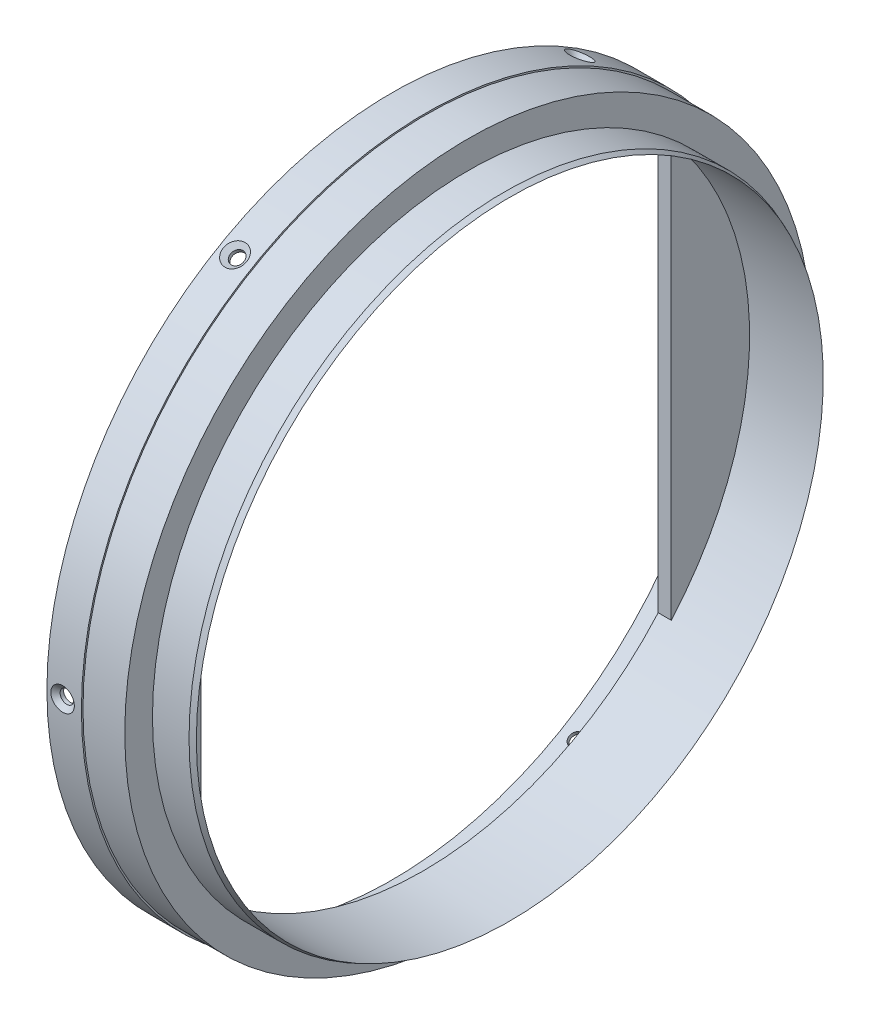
ISO-10303-21;
HEADER;
FILE_DESCRIPTION(('STEP AP214'),'2;1');
FILE_NAME('part.step','',(''),(''),'','','');
FILE_SCHEMA(('AUTOMOTIVE_DESIGN { 1 0 10303 214 1 1 1 1 }'));
ENDSEC;
DATA;
#1=APPLICATION_CONTEXT('core data for automotive mechanical design processes');
#2=APPLICATION_PROTOCOL_DEFINITION('international standard','automotive_design',2000,#1);
#3=PRODUCT_CONTEXT('',#1,'mechanical');
#4=PRODUCT('Part','Part','',(#3));
#5=PRODUCT_RELATED_PRODUCT_CATEGORY('part','',(#4));
#6=PRODUCT_DEFINITION_FORMATION('','',#4);
#7=PRODUCT_DEFINITION_CONTEXT('part definition',#1,'design');
#8=PRODUCT_DEFINITION('design','',#6,#7);
#9=PRODUCT_DEFINITION_SHAPE('','',#8);
#10=(LENGTH_UNIT() NAMED_UNIT(*) SI_UNIT(.MILLI.,.METRE.));
#11=(NAMED_UNIT(*) PLANE_ANGLE_UNIT() SI_UNIT($,.RADIAN.));
#12=(NAMED_UNIT(*) SI_UNIT($,.STERADIAN.) SOLID_ANGLE_UNIT());
#13=UNCERTAINTY_MEASURE_WITH_UNIT(LENGTH_MEASURE(1.E-05),#10,'distance_accuracy_value','');
#14=(GEOMETRIC_REPRESENTATION_CONTEXT(3) GLOBAL_UNCERTAINTY_ASSIGNED_CONTEXT((#13)) GLOBAL_UNIT_ASSIGNED_CONTEXT((#10,
#11,#12)) REPRESENTATION_CONTEXT('',''));
#15=CARTESIAN_POINT('',(0.,0.,0.));
#16=DIRECTION('',(0.,0.,1.));
#17=DIRECTION('',(1.,0.,0.));
#18=AXIS2_PLACEMENT_3D('',#15,#16,#17);
#19=CARTESIAN_POINT('',(-6.35,0.,76.2));
#20=DIRECTION('',(-1.,0.,0.));
#21=DIRECTION('',(0.,0.,1.));
#22=AXIS2_PLACEMENT_3D('',#19,#20,#21);
#23=CYLINDRICAL_SURFACE('',#22,76.2);
#24=DIRECTION('',(-1.,0.,0.));
#25=VECTOR('',#24,1.);
#26=CARTESIAN_POINT('',(-6.35,-50.4015624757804,133.35));
#27=LINE('',#26,#25);
#28=CARTESIAN_POINT('',(3.175,-50.4015624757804,133.35));
#29=VERTEX_POINT('',#28);
#30=CARTESIAN_POINT('',(0.,-50.4015624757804,133.35));
#31=VERTEX_POINT('',#30);
#32=EDGE_CURVE('E66',#29,#31,#27,.T.);
#33=ORIENTED_EDGE('',*,*,#32,.F.);
#34=CARTESIAN_POINT('',(3.175,0.,76.2));
#35=DIRECTION('',(-1.,0.,0.));
#36=DIRECTION('',(0.,0.,1.));
#37=AXIS2_PLACEMENT_3D('',#34,#35,#36);
#38=CIRCLE('',#37,76.2);
#39=CARTESIAN_POINT('',(3.175,50.4015624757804,133.35));
#40=VERTEX_POINT('',#39);
#41=EDGE_CURVE('E61',#29,#40,#38,.T.);
#42=ORIENTED_EDGE('',*,*,#41,.T.);
#43=DIRECTION('',(-1.,0.,0.));
#44=VECTOR('',#43,1.);
#45=CARTESIAN_POINT('',(-6.35,50.4015624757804,133.35));
#46=LINE('',#45,#44);
#47=CARTESIAN_POINT('',(0.,50.4015624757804,133.35));
#48=VERTEX_POINT('',#47);
#49=EDGE_CURVE('E97',#48,#40,#46,.F.);
#50=ORIENTED_EDGE('',*,*,#49,.F.);
#51=CARTESIAN_POINT('',(0.,0.,76.2));
#52=DIRECTION('',(-1.,0.,0.));
#53=DIRECTION('',(0.,0.,1.));
#54=AXIS2_PLACEMENT_3D('',#51,#52,#53);
#55=CIRCLE('',#54,76.2);
#56=CARTESIAN_POINT('',(0.,50.4015624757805,19.05));
#57=VERTEX_POINT('',#56);
#58=EDGE_CURVE('E86',#48,#57,#55,.T.);
#59=ORIENTED_EDGE('',*,*,#58,.T.);
#60=DIRECTION('',(-1.,0.,0.));
#61=VECTOR('',#60,1.);
#62=CARTESIAN_POINT('',(-6.35,50.4015624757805,19.05));
#63=LINE('',#62,#61);
#64=CARTESIAN_POINT('',(3.175,50.4015624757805,19.05));
#65=VERTEX_POINT('',#64);
#66=EDGE_CURVE('E508',#57,#65,#63,.F.);
#67=ORIENTED_EDGE('',*,*,#66,.T.);
#68=CARTESIAN_POINT('',(3.175,0.,76.2));
#69=DIRECTION('',(-1.,0.,0.));
#70=DIRECTION('',(0.,0.,1.));
#71=AXIS2_PLACEMENT_3D('',#68,#69,#70);
#72=CIRCLE('',#71,76.2);
#73=CARTESIAN_POINT('',(3.175,-50.4015624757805,19.05));
#74=VERTEX_POINT('',#73);
#75=EDGE_CURVE('E151',#65,#74,#72,.T.);
#76=ORIENTED_EDGE('',*,*,#75,.T.);
#77=DIRECTION('',(-1.,0.,0.));
#78=VECTOR('',#77,1.);
#79=CARTESIAN_POINT('',(-6.35,-50.4015624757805,19.05));
#80=LINE('',#79,#78);
#81=CARTESIAN_POINT('',(0.,-50.4015624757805,19.05));
#82=VERTEX_POINT('',#81);
#83=EDGE_CURVE('E506',#74,#82,#80,.T.);
#84=ORIENTED_EDGE('',*,*,#83,.T.);
#85=EDGE_CURVE('E94',#82,#31,#55,.T.);
#86=ORIENTED_EDGE('',*,*,#85,.T.);
#87=EDGE_LOOP('',(#33,#42,#50,#59,#67,#76,#84,#86));
#88=FACE_BOUND('',#87,.T.);
#89=CARTESIAN_POINT('',(21.082,0.,76.2));
#90=DIRECTION('',(-1.,0.,0.));
#91=DIRECTION('',(0.,0.,1.));
#92=AXIS2_PLACEMENT_3D('',#89,#90,#91);
#93=CIRCLE('',#92,76.2);
#94=CARTESIAN_POINT('',(21.082,0.,152.4));
#95=VERTEX_POINT('',#94);
#96=EDGE_CURVE('E95',#95,#95,#93,.T.);
#97=ORIENTED_EDGE('',*,*,#96,.F.);
#98=EDGE_LOOP('',(#97));
#99=FACE_BOUND('',#98,.T.);
#100=ADVANCED_FACE('F42',(#88,#99),#23,.F.);
#101=CARTESIAN_POINT('',(-7.62,0.,0.));
#102=DIRECTION('',(1.,0.,0.));
#103=DIRECTION('',(0.,0.,-1.));
#104=AXIS2_PLACEMENT_3D('',#101,#102,#103);
#105=PLANE('',#104);
#106=CARTESIAN_POINT('',(-7.62,0.,76.2));
#107=DIRECTION('',(-1.,0.,0.));
#108=DIRECTION('',(0.,0.,1.));
#109=AXIS2_PLACEMENT_3D('',#106,#107,#108);
#110=CIRCLE('',#109,81.9404);
#111=CARTESIAN_POINT('',(-7.62,0.,158.1404));
#112=VERTEX_POINT('',#111);
#113=EDGE_CURVE('E152',#112,#112,#110,.T.);
#114=ORIENTED_EDGE('',*,*,#113,.F.);
#115=EDGE_LOOP('',(#114));
#116=FACE_BOUND('',#115,.T.);
#117=CARTESIAN_POINT('',(-7.62,0.,76.2));
#118=DIRECTION('',(-1.,0.,0.));
#119=DIRECTION('',(0.,0.,1.));
#120=AXIS2_PLACEMENT_3D('',#117,#118,#119);
#121=CIRCLE('',#120,83.82);
#122=CARTESIAN_POINT('',(-7.62,0.,160.02));
#123=VERTEX_POINT('',#122);
#124=EDGE_CURVE('E127',#123,#123,#121,.T.);
#125=ORIENTED_EDGE('',*,*,#124,.T.);
#126=EDGE_LOOP('',(#125));
#127=FACE_BOUND('',#126,.T.);
#128=ADVANCED_FACE('F44',(#116,#127),#105,.F.);
#129=CARTESIAN_POINT('',(-6.35,0.,76.2));
#130=DIRECTION('',(-1.,0.,0.));
#131=DIRECTION('',(0.,0.,1.));
#132=AXIS2_PLACEMENT_3D('',#129,#130,#131);
#133=CYLINDRICAL_SURFACE('',#132,81.9404);
#134=CARTESIAN_POINT('',(-3.81,71.7643676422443,36.6512365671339));
#135=CARTESIAN_POINT('',(-3.90165759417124,71.7643658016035,36.6512329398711));
#136=CARTESIAN_POINT('',(-3.9933814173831,71.7606284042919,36.644449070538));
#137=CARTESIAN_POINT('',(-4.17430227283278,71.745760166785,36.6174877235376));
#138=CARTESIAN_POINT('',(-4.26349613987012,71.7346204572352,36.5972941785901));
#139=CARTESIAN_POINT('',(-4.43670985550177,71.7052321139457,36.5441081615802));
#140=CARTESIAN_POINT('',(-4.52073217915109,71.6869869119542,36.5111218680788));
#141=CARTESIAN_POINT('',(-4.68123340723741,71.6438597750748,36.4333245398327));
#142=CARTESIAN_POINT('',(-4.75771416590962,71.6189794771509,36.3885164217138));
#143=CARTESIAN_POINT('',(-4.90100654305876,71.5632171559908,36.2883678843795));
#144=CARTESIAN_POINT('',(-4.96781594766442,71.5323337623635,36.2330250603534));
#145=CARTESIAN_POINT('',(-5.08985081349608,71.4653761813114,36.1134206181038));
#146=CARTESIAN_POINT('',(-5.14507581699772,71.429301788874,36.0491586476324));
#147=CARTESIAN_POINT('',(-5.24237451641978,71.3529191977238,35.9135740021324));
#148=CARTESIAN_POINT('',(-5.2844473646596,71.3126107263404,35.8422508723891));
#149=CARTESIAN_POINT('',(-5.35424174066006,71.2288510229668,35.6946036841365));
#150=CARTESIAN_POINT('',(-5.38196330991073,71.1853998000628,35.6182796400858));
#151=CARTESIAN_POINT('',(-5.42226477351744,71.0965552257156,35.4628302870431));
#152=CARTESIAN_POINT('',(-5.43484667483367,71.051162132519,35.3837053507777));
#153=CARTESIAN_POINT('',(-5.44451781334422,70.9596990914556,35.224902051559));
#154=CARTESIAN_POINT('',(-5.44160709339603,70.9136291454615,35.1452236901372));
#155=CARTESIAN_POINT('',(-5.42037736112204,70.8221312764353,34.9875846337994));
#156=CARTESIAN_POINT('',(-5.40206053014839,70.7767032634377,34.9096236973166));
#157=CARTESIAN_POINT('',(-5.3505418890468,70.6877982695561,34.7576051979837));
#158=CARTESIAN_POINT('',(-5.31734005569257,70.6443212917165,34.6835476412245));
#159=CARTESIAN_POINT('',(-5.23699139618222,70.5605945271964,34.5414058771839));
#160=CARTESIAN_POINT('',(-5.18984356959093,70.520344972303,34.4733220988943));
#161=CARTESIAN_POINT('',(-5.08294205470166,70.4442778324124,34.3450308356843));
#162=CARTESIAN_POINT('',(-5.02318835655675,70.4084602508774,34.2848233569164));
#163=CARTESIAN_POINT('',(-4.89275892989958,70.3423341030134,34.1739442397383));
#164=CARTESIAN_POINT('',(-4.82208130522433,70.312026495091,34.1232742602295));
#165=CARTESIAN_POINT('',(-4.67181702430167,70.2578547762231,34.0328827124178));
#166=CARTESIAN_POINT('',(-4.59223036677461,70.2339906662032,33.9931611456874));
#167=CARTESIAN_POINT('',(-4.42640618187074,70.193442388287,33.9257601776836));
#168=CARTESIAN_POINT('',(-4.34016862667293,70.1767582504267,33.8980808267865));
#169=CARTESIAN_POINT('',(-4.16349113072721,70.1510886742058,33.8555253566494));
#170=CARTESIAN_POINT('',(-4.07305119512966,70.14210322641,33.8406492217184));
#171=CARTESIAN_POINT('',(-3.89055288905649,70.1321124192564,33.824109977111));
#172=CARTESIAN_POINT('',(-3.79849479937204,70.1311056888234,33.8224445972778));
#173=CARTESIAN_POINT('',(-3.61535879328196,70.1371001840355,33.8323665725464));
#174=CARTESIAN_POINT('',(-3.52428087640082,70.1441014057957,33.8439539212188));
#175=CARTESIAN_POINT('',(-3.34569800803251,70.1658922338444,33.8800619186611));
#176=CARTESIAN_POINT('',(-3.2581927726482,70.1806812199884,33.9045815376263));
#177=CARTESIAN_POINT('',(-3.08923055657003,70.2175871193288,33.9658800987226));
#178=CARTESIAN_POINT('',(-3.00777358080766,70.2397040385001,34.0026590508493));
#179=CARTESIAN_POINT('',(-2.85320796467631,70.2905856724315,34.0874703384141));
#180=CARTESIAN_POINT('',(-2.78010046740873,70.3193512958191,34.1355042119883));
#181=CARTESIAN_POINT('',(-2.64432055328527,70.3826470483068,34.2414973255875));
#182=CARTESIAN_POINT('',(-2.58164815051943,70.4171771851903,34.299456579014));
#183=CARTESIAN_POINT('',(-2.46850867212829,70.4909600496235,34.4237039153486));
#184=CARTESIAN_POINT('',(-2.41804330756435,70.5302134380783,34.4899931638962));
#185=CARTESIAN_POINT('',(-2.33076217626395,70.612262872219,34.6290486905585));
#186=CARTESIAN_POINT('',(-2.29394638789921,70.6550589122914,34.7018149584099));
#187=CARTESIAN_POINT('',(-2.23501245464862,70.7429259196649,34.85178201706));
#188=CARTESIAN_POINT('',(-2.21289319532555,70.7879967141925,34.9289824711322));
#189=CARTESIAN_POINT('',(-2.18397654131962,70.879105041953,35.0856493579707));
#190=CARTESIAN_POINT('',(-2.17717915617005,70.9251425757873,35.1651157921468));
#191=CARTESIAN_POINT('',(-2.17909936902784,71.0168589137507,35.3240496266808));
#192=CARTESIAN_POINT('',(-2.18781425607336,71.0625377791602,35.4035170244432));
#193=CARTESIAN_POINT('',(-2.22050608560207,71.1522610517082,35.5602035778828));
#194=CARTESIAN_POINT('',(-2.2444830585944,71.1963054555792,35.6374227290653));
#195=CARTESIAN_POINT('',(-2.30701838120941,71.2815444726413,35.7874027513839));
#196=CARTESIAN_POINT('',(-2.34557699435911,71.3227390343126,35.8601635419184));
#197=CARTESIAN_POINT('',(-2.43617919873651,71.4011587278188,35.9991286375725));
#198=CARTESIAN_POINT('',(-2.48822227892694,71.4383840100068,36.0653331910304));
#199=CARTESIAN_POINT('',(-2.60432055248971,71.507876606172,36.1892790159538));
#200=CARTESIAN_POINT('',(-2.66837656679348,71.5401435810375,36.2470197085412));
#201=CARTESIAN_POINT('',(-2.80670167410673,71.5988763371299,36.3523688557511));
#202=CARTESIAN_POINT('',(-2.88097329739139,71.6253406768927,36.3999747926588));
#203=CARTESIAN_POINT('',(-3.0376413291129,71.671783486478,36.483669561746));
#204=CARTESIAN_POINT('',(-3.12004220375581,71.6917583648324,36.5197520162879));
#205=CARTESIAN_POINT('',(-3.29053467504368,71.7246710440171,36.5792745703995));
#206=CARTESIAN_POINT('',(-3.37861932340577,71.7376172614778,36.6027297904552));
#207=CARTESIAN_POINT('',(-3.52438597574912,71.7527019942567,36.6300740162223));
#208=CARTESIAN_POINT('',(-3.58112126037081,71.7570716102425,36.6379997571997));
#209=CARTESIAN_POINT('',(-3.69522903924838,71.7629050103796,36.6485821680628));
#210=CARTESIAN_POINT('',(-3.75260153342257,71.7643687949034,36.651238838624));
#211=CARTESIAN_POINT('',(-3.81,71.7643676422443,36.6512365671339));
#212=B_SPLINE_CURVE_WITH_KNOTS('',3,(#134,#135,#136,#137,#138,#139,#140,#141,#142,#143,#144,
#145,#146,#147,#148,#149,#150,#151,#152,#153,#154,#155,#156,#157,#158,#159,#160,#161,#162,#163,
#164,#165,#166,#167,#168,#169,#170,#171,#172,#173,#174,#175,#176,#177,#178,#179,#180,#181,#182,
#183,#184,#185,#186,#187,#188,#189,#190,#191,#192,#193,#194,#195,#196,#197,#198,#199,#200,#201,
#202,#203,#204,#205,#206,#207,#208,#209,#210,#211),.UNSPECIFIED.,.T.,.F.,(4,2,2,2,2,2,2,2,2,2,2,
2,2,2,2,2,2,2,2,2,2,2,2,2,2,2,2,2,2,2,2,2,2,2,2,2,2,2,4),(0.,0.274763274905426,
0.549856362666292,0.824816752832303,1.09970936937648,1.37466481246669,1.64963111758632,
1.92461514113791,2.1995983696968,2.47454514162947,2.7494911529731,3.02439824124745,
3.29930575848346,3.57423300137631,3.84916045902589,4.12413569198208,4.39911096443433,
4.67408738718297,4.94906347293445,5.22399230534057,5.498921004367,5.77382781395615,
6.04873484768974,6.32367947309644,6.59862446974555,6.87360798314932,7.14859106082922,
7.42355328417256,7.69851567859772,7.97343002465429,8.24834492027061,8.52326478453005,
8.79817423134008,9.07310247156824,9.34809893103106,9.62324732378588,9.89806550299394,
10.0701297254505,10.2421939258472),.UNSPECIFIED.);
#213=CARTESIAN_POINT('',(-3.81,71.7643676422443,36.6512365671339));
#214=VERTEX_POINT('',#213);
#215=EDGE_CURVE('E283',#214,#214,#212,.T.);
#216=ORIENTED_EDGE('',*,*,#215,.F.);
#217=EDGE_LOOP('',(#216));
#218=FACE_BOUND('',#217,.T.);
#219=CARTESIAN_POINT('',(-3.81,70.1324176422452,118.575383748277));
#220=CARTESIAN_POINT('',(-3.90165759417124,70.1324198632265,118.575380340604));
#221=CARTESIAN_POINT('',(-3.9933814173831,70.1364261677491,118.568751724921));
#222=CARTESIAN_POINT('',(-4.17430227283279,70.1523412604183,118.54239478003));
#223=CARTESIAN_POINT('',(-4.26349613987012,70.1642595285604,118.522650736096));
#224=CARTESIAN_POINT('',(-4.43670985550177,70.1956257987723,118.470606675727));
#225=CARTESIAN_POINT('',(-4.52073217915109,70.2150701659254,118.438312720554));
#226=CARTESIAN_POINT('',(-4.68123340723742,70.2608810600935,118.362064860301));
#227=CARTESIAN_POINT('',(-4.75771416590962,70.2872458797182,118.318113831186));
#228=CARTESIAN_POINT('',(-4.90100654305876,70.3460958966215,118.21974797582));
#229=CARTESIAN_POINT('',(-4.96781594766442,70.3785824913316,118.165330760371));
#230=CARTESIAN_POINT('',(-5.08985081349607,70.4486841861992,118.047541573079));
#231=CARTESIAN_POINT('',(-5.14507581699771,70.486299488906,117.984169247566));
#232=CARTESIAN_POINT('',(-5.24237451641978,70.565527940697,117.850227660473));
#233=CARTESIAN_POINT('',(-5.2844473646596,70.6071413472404,117.779657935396));
#234=CARTESIAN_POINT('',(-5.35424174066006,70.6931277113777,117.633296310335));
#235=CARTESIAN_POINT('',(-5.38196330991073,70.7375006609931,117.557504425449));
#236=CARTESIAN_POINT('',(-5.42226477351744,70.8277014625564,117.402838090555));
#237=CARTESIAN_POINT('',(-5.43484667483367,70.8735291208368,117.323964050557));
#238=CARTESIAN_POINT('',(-5.44451781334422,70.9653252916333,117.16535308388));
#239=CARTESIAN_POINT('',(-5.44160709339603,71.0112938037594,117.085616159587));
#240=CARTESIAN_POINT('',(-5.42037736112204,71.1020642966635,116.927557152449));
#241=CARTESIAN_POINT('',(-5.40206053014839,71.1468664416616,116.849234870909));
#242=CARTESIAN_POINT('',(-5.3505418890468,71.2340658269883,116.696231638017));
#243=CARTESIAN_POINT('',(-5.31734005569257,71.2764630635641,116.621550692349));
#244=CARTESIAN_POINT('',(-5.23699139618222,71.357698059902,116.477970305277));
#245=CARTESIAN_POINT('',(-5.18984356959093,71.3965355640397,116.409071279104));
#246=CARTESIAN_POINT('',(-5.08294205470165,71.4696054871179,116.27904957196));
#247=CARTESIAN_POINT('',(-5.02318835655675,71.5038379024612,116.217926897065));
#248=CARTESIAN_POINT('',(-4.89275892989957,71.5667989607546,116.105220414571));
#249=CARTESIAN_POINT('',(-4.82208130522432,71.5955266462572,116.053638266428));
#250=CARTESIAN_POINT('',(-4.67181702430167,71.6467221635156,115.961528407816));
#251=CARTESIAN_POINT('',(-4.59223036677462,71.6691899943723,115.921000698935));
#252=CARTESIAN_POINT('',(-4.42640618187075,71.7072868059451,115.852184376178));
#253=CARTESIAN_POINT('',(-4.34016862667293,71.7229157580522,115.823895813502));
#254=CARTESIAN_POINT('',(-4.16349113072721,71.7469350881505,115.780387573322));
#255=CARTESIAN_POINT('',(-4.07305119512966,71.7553254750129,115.765167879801));
#256=CARTESIAN_POINT('',(-3.89055288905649,71.7646534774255,115.748245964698));
#257=CARTESIAN_POINT('',(-3.79849479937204,71.7655923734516,115.746541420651));
#258=CARTESIAN_POINT('',(-3.61535879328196,71.7599969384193,115.756693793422));
#259=CARTESIAN_POINT('',(-3.52428087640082,71.7534626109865,115.76855070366));
#260=CARTESIAN_POINT('',(-3.34569800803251,71.7330875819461,115.805476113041));
#261=CARTESIAN_POINT('',(-3.2581927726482,71.7192474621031,115.830543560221));
#262=CARTESIAN_POINT('',(-3.08923055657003,71.6846143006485,115.893154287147));
#263=CARTESIAN_POINT('',(-3.00777358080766,71.6638212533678,115.930697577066));
#264=CARTESIAN_POINT('',(-2.85320796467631,71.6158133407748,116.017168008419));
#265=CARTESIAN_POINT('',(-2.78010046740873,71.5885975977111,116.066096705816));
#266=CARTESIAN_POINT('',(-2.64432055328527,71.5284527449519,116.173908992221));
#267=CARTESIAN_POINT('',(-2.58164815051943,71.4955236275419,116.232792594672));
#268=CARTESIAN_POINT('',(-2.46850867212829,71.4248137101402,116.358814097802));
#269=CARTESIAN_POINT('',(-2.41804330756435,71.3870322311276,116.425953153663));
#270=CARTESIAN_POINT('',(-2.33076217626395,71.3076313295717,116.566537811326));
#271=CARTESIAN_POINT('',(-2.29394638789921,71.2660119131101,116.639983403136));
#272=CARTESIAN_POINT('',(-2.23501245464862,71.1800701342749,116.791061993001));
#273=CARTESIAN_POINT('',(-2.21289319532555,71.1357479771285,116.868694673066));
#274=CARTESIAN_POINT('',(-2.18397654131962,71.0456246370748,117.025930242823));
#275=CARTESIAN_POINT('',(-2.17717915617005,70.9998234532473,117.105533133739));
#276=CARTESIAN_POINT('',(-2.17909936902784,70.9080408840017,117.264428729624));
#277=CARTESIAN_POINT('',(-2.18781425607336,70.8620595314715,117.343721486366));
#278=CARTESIAN_POINT('',(-2.22050608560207,70.7712266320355,117.499767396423));
#279=CARTESIAN_POINT('',(-2.2444830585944,70.7263750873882,117.576520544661));
#280=CARTESIAN_POINT('',(-2.30701838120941,70.6391080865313,117.72532970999));
#281=CARTESIAN_POINT('',(-2.34557699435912,70.5966926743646,117.797385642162));
#282=CARTESIAN_POINT('',(-2.43617919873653,70.5155552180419,117.934781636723));
#283=CARTESIAN_POINT('',(-2.48822227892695,70.4768330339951,118.000121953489));
#284=CARTESIAN_POINT('',(-2.60432055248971,70.404239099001,118.122277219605));
#285=CARTESIAN_POINT('',(-2.66837656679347,70.370367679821,118.179091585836));
#286=CARTESIAN_POINT('',(-2.80670167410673,70.3084990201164,118.282630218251));
#287=CARTESIAN_POINT('',(-2.8809732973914,70.2805032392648,118.329351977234));
#288=CARTESIAN_POINT('',(-3.03764132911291,70.231242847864,118.411420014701));
#289=CARTESIAN_POINT('',(-3.12004220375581,70.209981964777,118.446759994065));
#290=CARTESIAN_POINT('',(-3.29053467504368,70.1748902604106,118.505024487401));
#291=CARTESIAN_POINT('',(-3.37861932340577,70.1610505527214,118.527963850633));
#292=CARTESIAN_POINT('',(-3.52438597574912,70.1449121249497,118.554699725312));
#293=CARTESIAN_POINT('',(-3.58112126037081,70.1402330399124,118.562446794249));
#294=CARTESIAN_POINT('',(-3.69522903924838,70.1339851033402,118.57278987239));
#295=CARTESIAN_POINT('',(-3.75260153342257,70.1324162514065,118.575385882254));
#296=CARTESIAN_POINT('',(-3.81,70.1324176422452,118.575383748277));
#297=B_SPLINE_CURVE_WITH_KNOTS('',3,(#219,#220,#221,#222,#223,#224,#225,#226,#227,#228,#229,
#230,#231,#232,#233,#234,#235,#236,#237,#238,#239,#240,#241,#242,#243,#244,#245,#246,#247,#248,
#249,#250,#251,#252,#253,#254,#255,#256,#257,#258,#259,#260,#261,#262,#263,#264,#265,#266,#267,
#268,#269,#270,#271,#272,#273,#274,#275,#276,#277,#278,#279,#280,#281,#282,#283,#284,#285,#286,
#287,#288,#289,#290,#291,#292,#293,#294,#295,#296),.UNSPECIFIED.,.T.,.F.,(4,2,2,2,2,2,2,2,2,2,2,
2,2,2,2,2,2,2,2,2,2,2,2,2,2,2,2,2,2,2,2,2,2,2,2,2,2,2,4),(0.,0.274763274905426,
0.549856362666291,0.824816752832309,1.09970936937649,1.37466481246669,1.64963111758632,
1.92461514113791,2.1995983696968,2.47454514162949,2.7494911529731,3.02439824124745,
3.29930575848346,3.57423300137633,3.8491604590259,4.12413569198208,4.39911096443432,
4.67408738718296,4.94906347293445,5.22399230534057,5.498921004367,5.77382781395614,
6.04873484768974,6.32367947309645,6.59862446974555,6.8736079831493,7.14859106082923,
7.42355328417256,7.69851567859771,7.9734300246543,8.24834492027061,8.52326478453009,
8.79817423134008,9.07310247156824,9.34809893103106,9.62324732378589,9.89806550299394,
10.0701297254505,10.2421939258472),.UNSPECIFIED.);
#298=CARTESIAN_POINT('',(-3.81,70.1324176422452,118.575383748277));
#299=VERTEX_POINT('',#298);
#300=EDGE_CURVE('E203',#299,#299,#297,.T.);
#301=ORIENTED_EDGE('',*,*,#300,.F.);
#302=EDGE_LOOP('',(#301));
#303=FACE_BOUND('',#302,.T.);
#304=CARTESIAN_POINT('',(-3.81,-1.63194999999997,158.124147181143));
#305=CARTESIAN_POINT('',(-3.90165759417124,-1.63194593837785,158.124147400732));
#306=CARTESIAN_POINT('',(-3.9933814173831,-1.6242022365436,158.124302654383));
#307=CARTESIAN_POINT('',(-4.17430227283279,-1.59341890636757,158.124907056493));
#308=CARTESIAN_POINT('',(-4.26349613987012,-1.57036092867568,158.125356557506));
#309=CARTESIAN_POINT('',(-4.43670985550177,-1.50960631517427,158.126498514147));
#310=CARTESIAN_POINT('',(-4.52073217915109,-1.47191674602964,158.127190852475));
#311=CARTESIAN_POINT('',(-4.68123340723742,-1.38297871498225,158.128740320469));
#312=CARTESIAN_POINT('',(-4.75771416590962,-1.33173359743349,158.129597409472));
#313=CARTESIAN_POINT('',(-4.90100654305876,-1.21712125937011,158.131380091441));
#314=CARTESIAN_POINT('',(-4.96781594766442,-1.15375127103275,158.132305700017));
#315=CARTESIAN_POINT('',(-5.08985081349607,-1.01669199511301,158.134120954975));
#316=CARTESIAN_POINT('',(-5.14507581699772,-0.943002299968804,158.135010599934));
#317=CARTESIAN_POINT('',(-5.24237451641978,-0.787391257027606,158.136653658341));
#318=CARTESIAN_POINT('',(-5.28444736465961,-0.705469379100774,158.137407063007));
#319=CARTESIAN_POINT('',(-5.35424174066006,-0.535723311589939,158.138692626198));
#320=CARTESIAN_POINT('',(-5.38196330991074,-0.447899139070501,158.139224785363));
#321=CARTESIAN_POINT('',(-5.42226477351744,-0.268853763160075,158.140007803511));
#322=CARTESIAN_POINT('',(-5.43484667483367,-0.177633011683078,158.14025869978));
#323=CARTESIAN_POINT('',(-5.44451781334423,0.00562620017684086,158.140451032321));
#324=CARTESIAN_POINT('',(-5.44160709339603,0.0976646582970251,158.14039246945));
#325=CARTESIAN_POINT('',(-5.42037736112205,0.279933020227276,158.13997251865));
#326=CARTESIAN_POINT('',(-5.4020605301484,0.370163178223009,158.139611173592));
#327=CARTESIAN_POINT('',(-5.35054188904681,0.546267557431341,158.138626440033));
#328=CARTESIAN_POINT('',(-5.31734005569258,0.63214177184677,158.138003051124));
#329=CARTESIAN_POINT('',(-5.23699139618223,0.797103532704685,158.136564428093));
#330=CARTESIAN_POINT('',(-5.18984356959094,0.876190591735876,158.135749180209));
#331=CARTESIAN_POINT('',(-5.08294205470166,1.02532765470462,158.134018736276));
#332=CARTESIAN_POINT('',(-5.02318835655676,1.09537765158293,158.133103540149));
#333=CARTESIAN_POINT('',(-4.89275892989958,1.22446485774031,158.131276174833));
#334=CARTESIAN_POINT('',(-4.82208130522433,1.2835001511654,158.130364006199));
#335=CARTESIAN_POINT('',(-4.67181702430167,1.3888673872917,158.128645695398));
#336=CARTESIAN_POINT('',(-4.59223036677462,1.43519932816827,158.127839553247));
#337=CARTESIAN_POINT('',(-4.42640618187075,1.51384441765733,158.126424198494));
#338=CARTESIAN_POINT('',(-4.34016862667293,1.5461575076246,158.125814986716));
#339=CARTESIAN_POINT('',(-4.16349113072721,1.59584641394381,158.124862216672));
#340=CARTESIAN_POINT('',(-4.07305119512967,1.61322224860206,158.124518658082));
#341=CARTESIAN_POINT('',(-3.89055288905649,1.63254105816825,158.124135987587));
#342=CARTESIAN_POINT('',(-3.79849479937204,1.63448668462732,158.124096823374));
#343=CARTESIAN_POINT('',(-3.61535879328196,1.62289675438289,158.124327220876));
#344=CARTESIAN_POINT('',(-3.52428087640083,1.60936120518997,158.124596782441));
#345=CARTESIAN_POINT('',(-3.34569800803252,1.5671953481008,158.12541419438));
#346=CARTESIAN_POINT('',(-3.2581927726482,1.53856624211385,158.125962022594));
#347=CARTESIAN_POINT('',(-3.08923055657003,1.46702718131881,158.127274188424));
#348=CARTESIAN_POINT('',(-3.00777358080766,1.4241172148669,158.128038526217));
#349=CARTESIAN_POINT('',(-2.85320796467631,1.32522766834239,158.129697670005));
#350=CARTESIAN_POINT('',(-2.78010046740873,1.26924630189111,158.130592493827));
#351=CARTESIAN_POINT('',(-2.64432055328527,1.14580569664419,158.132411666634));
#352=CARTESIAN_POINT('',(-2.58164815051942,1.07834644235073,158.133336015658));
#353=CARTESIAN_POINT('',(-2.46850867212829,0.933853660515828,158.135110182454));
#354=CARTESIAN_POINT('',(-2.41804330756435,0.856818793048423,158.135959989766));
#355=CARTESIAN_POINT('',(-2.33076217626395,0.695368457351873,158.137489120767));
#356=CARTESIAN_POINT('',(-2.2939463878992,0.610953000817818,158.138168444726));
#357=CARTESIAN_POINT('',(-2.23501245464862,0.437144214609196,158.13927997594));
#358=CARTESIAN_POINT('',(-2.21289319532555,0.347751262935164,158.139712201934));
#359=CARTESIAN_POINT('',(-2.18397654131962,0.16651959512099,158.140280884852));
#360=CARTESIAN_POINT('',(-2.17717915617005,0.0746808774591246,158.140417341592));
#361=CARTESIAN_POINT('',(-2.17909936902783,-0.108818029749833,158.140379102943));
#362=CARTESIAN_POINT('',(-2.18781425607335,-0.200478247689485,158.140204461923));
#363=CARTESIAN_POINT('',(-2.22050608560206,-0.381034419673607,158.13956381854));
#364=CARTESIAN_POINT('',(-2.24448305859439,-0.469930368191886,158.139097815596));
#365=CARTESIAN_POINT('',(-2.3070183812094,-0.642436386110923,158.137926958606));
#366=CARTESIAN_POINT('',(-2.34557699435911,-0.726046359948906,158.137222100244));
#367=CARTESIAN_POINT('',(-2.43617919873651,-0.885603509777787,158.13565299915));
#368=CARTESIAN_POINT('',(-2.48822227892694,-0.961550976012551,158.134788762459));
#369=CARTESIAN_POINT('',(-2.6043205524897,-1.10363750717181,158.132998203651));
#370=CARTESIAN_POINT('',(-2.66837656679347,-1.16977590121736,158.132071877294));
#371=CARTESIAN_POINT('',(-2.80670167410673,-1.29037731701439,158.130261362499));
#372=CARTESIAN_POINT('',(-2.88097329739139,-1.34483743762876,158.129377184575));
#373=CARTESIAN_POINT('',(-3.0376413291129,-1.44054063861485,158.127750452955));
#374=CARTESIAN_POINT('',(-3.12004220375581,-1.48177640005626,158.127007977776));
#375=CARTESIAN_POINT('',(-3.29053467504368,-1.54978078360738,158.125749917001));
#376=CARTESIAN_POINT('',(-3.37861932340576,-1.5765667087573,158.125234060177));
#377=CARTESIAN_POINT('',(-3.52438597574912,-1.6077898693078,158.12462570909));
#378=CARTESIAN_POINT('',(-3.58112126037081,-1.61683857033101,158.124447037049));
#379=CARTESIAN_POINT('',(-3.69522903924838,-1.62891990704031,158.124207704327));
#380=CARTESIAN_POINT('',(-3.75260153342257,-1.63195254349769,158.12414704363));
#381=CARTESIAN_POINT('',(-3.81,-1.63194999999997,158.124147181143));
#382=B_SPLINE_CURVE_WITH_KNOTS('',3,(#304,#305,#306,#307,#308,#309,#310,#311,#312,#313,#314,
#315,#316,#317,#318,#319,#320,#321,#322,#323,#324,#325,#326,#327,#328,#329,#330,#331,#332,#333,
#334,#335,#336,#337,#338,#339,#340,#341,#342,#343,#344,#345,#346,#347,#348,#349,#350,#351,#352,
#353,#354,#355,#356,#357,#358,#359,#360,#361,#362,#363,#364,#365,#366,#367,#368,#369,#370,#371,
#372,#373,#374,#375,#376,#377,#378,#379,#380,#381),.UNSPECIFIED.,.T.,.F.,(4,2,2,2,2,2,2,2,2,2,2,
2,2,2,2,2,2,2,2,2,2,2,2,2,2,2,2,2,2,2,2,2,2,2,2,2,2,2,4),(0.,0.274763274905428,
0.549856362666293,0.824816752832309,1.09970936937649,1.3746648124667,1.64963111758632,
1.92461514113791,2.19959836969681,2.4745451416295,2.74949115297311,3.02439824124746,
3.29930575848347,3.57423300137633,3.84916045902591,4.12413569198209,4.39911096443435,
4.67408738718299,4.94906347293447,5.22399230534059,5.49892100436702,5.77382781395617,
6.04873484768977,6.32367947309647,6.59862446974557,6.87360798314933,7.14859106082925,
7.42355328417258,7.69851567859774,7.97343002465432,8.24834492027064,8.5232647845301,
8.79817423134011,9.07310247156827,9.34809893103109,9.62324732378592,9.89806550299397,
10.0701297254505,10.2421939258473),.UNSPECIFIED.);
#383=CARTESIAN_POINT('',(-3.81,-1.63194999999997,158.124147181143));
#384=VERTEX_POINT('',#383);
#385=EDGE_CURVE('E214',#384,#384,#382,.T.);
#386=ORIENTED_EDGE('',*,*,#385,.F.);
#387=EDGE_LOOP('',(#386));
#388=FACE_BOUND('',#387,.T.);
#389=CARTESIAN_POINT('',(-3.81,-71.7643676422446,115.748763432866));
#390=CARTESIAN_POINT('',(-3.71834240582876,-71.7643658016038,115.748767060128));
#391=CARTESIAN_POINT('',(-3.6266185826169,-71.7606284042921,115.755550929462));
#392=CARTESIAN_POINT('',(-3.44569772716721,-71.7457601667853,115.782512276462));
#393=CARTESIAN_POINT('',(-3.35650386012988,-71.7346204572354,115.802705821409));
#394=CARTESIAN_POINT('',(-3.18329014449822,-71.705232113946,115.855891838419));
#395=CARTESIAN_POINT('',(-3.09926782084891,-71.6869869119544,115.888878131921));
#396=CARTESIAN_POINT('',(-2.93876659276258,-71.6438597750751,115.966675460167));
#397=CARTESIAN_POINT('',(-2.86228583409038,-71.6189794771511,116.011483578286));
#398=CARTESIAN_POINT('',(-2.71899345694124,-71.5632171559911,116.11163211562));
#399=CARTESIAN_POINT('',(-2.65218405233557,-71.5323337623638,116.166974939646));
#400=CARTESIAN_POINT('',(-2.53014918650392,-71.4653761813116,116.286579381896));
#401=CARTESIAN_POINT('',(-2.47492418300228,-71.4293017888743,116.350841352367));
#402=CARTESIAN_POINT('',(-2.37762548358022,-71.352919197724,116.486425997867));
#403=CARTESIAN_POINT('',(-2.3355526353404,-71.3126107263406,116.55774912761));
#404=CARTESIAN_POINT('',(-2.26575825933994,-71.228851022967,116.705396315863));
#405=CARTESIAN_POINT('',(-2.23803669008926,-71.1853998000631,116.781720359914));
#406=CARTESIAN_POINT('',(-2.19773522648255,-71.0965552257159,116.937169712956));
#407=CARTESIAN_POINT('',(-2.18515332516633,-71.0511621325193,117.016294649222));
#408=CARTESIAN_POINT('',(-2.17548218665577,-70.9596990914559,117.175097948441));
#409=CARTESIAN_POINT('',(-2.17839290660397,-70.9136291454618,117.254776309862));
#410=CARTESIAN_POINT('',(-2.19962263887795,-70.8221312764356,117.4124153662));
#411=CARTESIAN_POINT('',(-2.2179394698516,-70.776703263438,117.490376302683));
#412=CARTESIAN_POINT('',(-2.26945811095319,-70.6877982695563,117.642394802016));
#413=CARTESIAN_POINT('',(-2.30265994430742,-70.6443212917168,117.716452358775));
#414=CARTESIAN_POINT('',(-2.38300860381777,-70.5605945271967,117.858594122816));
#415=CARTESIAN_POINT('',(-2.43015643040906,-70.5203449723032,117.926677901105));
#416=CARTESIAN_POINT('',(-2.53705794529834,-70.4442778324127,118.054969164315));
#417=CARTESIAN_POINT('',(-2.59681164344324,-70.4084602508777,118.115176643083));
#418=CARTESIAN_POINT('',(-2.72724107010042,-70.3423341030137,118.226055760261));
#419=CARTESIAN_POINT('',(-2.79791869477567,-70.3120264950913,118.27672573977));
#420=CARTESIAN_POINT('',(-2.94818297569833,-70.2578547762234,118.367117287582));
#421=CARTESIAN_POINT('',(-3.02776963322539,-70.2339906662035,118.406838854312));
#422=CARTESIAN_POINT('',(-3.19359381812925,-70.1934423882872,118.474239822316));
#423=CARTESIAN_POINT('',(-3.27983137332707,-70.176758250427,118.501919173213));
#424=CARTESIAN_POINT('',(-3.45650886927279,-70.1510886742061,118.54447464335));
#425=CARTESIAN_POINT('',(-3.54694880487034,-70.1421032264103,118.559350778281));
#426=CARTESIAN_POINT('',(-3.72944711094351,-70.1321124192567,118.575890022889));
#427=CARTESIAN_POINT('',(-3.82150520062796,-70.1311056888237,118.577555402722));
#428=CARTESIAN_POINT('',(-4.00464120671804,-70.1371001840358,118.567633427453));
#429=CARTESIAN_POINT('',(-4.09571912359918,-70.144101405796,118.556046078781));
#430=CARTESIAN_POINT('',(-4.27430199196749,-70.1658922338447,118.519938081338));
#431=CARTESIAN_POINT('',(-4.3618072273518,-70.1806812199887,118.495418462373));
#432=CARTESIAN_POINT('',(-4.53076944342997,-70.2175871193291,118.434119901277));
#433=CARTESIAN_POINT('',(-4.61222641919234,-70.2397040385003,118.39734094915));
#434=CARTESIAN_POINT('',(-4.76679203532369,-70.2905856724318,118.312529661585));
#435=CARTESIAN_POINT('',(-4.83989953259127,-70.3193512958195,118.264495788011));
#436=CARTESIAN_POINT('',(-4.97567944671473,-70.3826470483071,118.158502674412));
#437=CARTESIAN_POINT('',(-5.03835184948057,-70.4171771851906,118.100543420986));
#438=CARTESIAN_POINT('',(-5.15149132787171,-70.4909600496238,117.976296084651));
#439=CARTESIAN_POINT('',(-5.20195669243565,-70.5302134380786,117.910006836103));
#440=CARTESIAN_POINT('',(-5.28923782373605,-70.6122628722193,117.770951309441));
#441=CARTESIAN_POINT('',(-5.32605361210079,-70.6550589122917,117.69818504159));
#442=CARTESIAN_POINT('',(-5.38498754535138,-70.7429259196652,117.548217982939));
#443=CARTESIAN_POINT('',(-5.40710680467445,-70.7879967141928,117.471017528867));
#444=CARTESIAN_POINT('',(-5.43602345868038,-70.8791050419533,117.314350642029));
#445=CARTESIAN_POINT('',(-5.44282084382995,-70.9251425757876,117.234884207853));
#446=CARTESIAN_POINT('',(-5.44090063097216,-71.0168589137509,117.075950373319));
#447=CARTESIAN_POINT('',(-5.43218574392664,-71.0625377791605,116.996482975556));
#448=CARTESIAN_POINT('',(-5.39949391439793,-71.1522610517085,116.839796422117));
#449=CARTESIAN_POINT('',(-5.3755169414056,-71.1963054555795,116.762577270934));
#450=CARTESIAN_POINT('',(-5.31298161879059,-71.2815444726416,116.612597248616));
#451=CARTESIAN_POINT('',(-5.27442300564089,-71.3227390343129,116.539836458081));
#452=CARTESIAN_POINT('',(-5.18382080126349,-71.4011587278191,116.400871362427));
#453=CARTESIAN_POINT('',(-5.13177772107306,-71.4383840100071,116.334666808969));
#454=CARTESIAN_POINT('',(-5.01567944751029,-71.5078766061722,116.210720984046));
#455=CARTESIAN_POINT('',(-4.95162343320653,-71.5401435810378,116.152980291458));
#456=CARTESIAN_POINT('',(-4.81329832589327,-71.5988763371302,116.047631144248));
#457=CARTESIAN_POINT('',(-4.7390267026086,-71.625340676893,116.000025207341));
#458=CARTESIAN_POINT('',(-4.58235867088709,-71.6717834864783,115.916330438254));
#459=CARTESIAN_POINT('',(-4.49995779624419,-71.6917583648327,115.880247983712));
#460=CARTESIAN_POINT('',(-4.32946532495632,-71.7246710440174,115.8207254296));
#461=CARTESIAN_POINT('',(-4.24138067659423,-71.7376172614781,115.797270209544));
#462=CARTESIAN_POINT('',(-4.09561402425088,-71.7527019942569,115.769925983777));
#463=CARTESIAN_POINT('',(-4.03887873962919,-71.7570716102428,115.7620002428));
#464=CARTESIAN_POINT('',(-3.92477096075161,-71.7629050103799,115.751417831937));
#465=CARTESIAN_POINT('',(-3.86739846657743,-71.7643687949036,115.748761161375));
#466=CARTESIAN_POINT('',(-3.81,-71.7643676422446,115.748763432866));
#467=B_SPLINE_CURVE_WITH_KNOTS('',3,(#389,#390,#391,#392,#393,#394,#395,#396,#397,#398,#399,
#400,#401,#402,#403,#404,#405,#406,#407,#408,#409,#410,#411,#412,#413,#414,#415,#416,#417,#418,
#419,#420,#421,#422,#423,#424,#425,#426,#427,#428,#429,#430,#431,#432,#433,#434,#435,#436,#437,
#438,#439,#440,#441,#442,#443,#444,#445,#446,#447,#448,#449,#450,#451,#452,#453,#454,#455,#456,
#457,#458,#459,#460,#461,#462,#463,#464,#465,#466),.UNSPECIFIED.,.T.,.F.,(4,2,2,2,2,2,2,2,2,2,2,
2,2,2,2,2,2,2,2,2,2,2,2,2,2,2,2,2,2,2,2,2,2,2,2,2,2,2,4),(0.,0.274763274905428,
0.549856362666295,0.82481675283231,1.09970936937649,1.3746648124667,1.64963111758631,
1.92461514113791,2.19959836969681,2.47454514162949,2.74949115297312,3.02439824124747,
3.29930575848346,3.57423300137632,3.84916045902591,4.1241356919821,4.39911096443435,
4.67408738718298,4.94906347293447,5.22399230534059,5.49892100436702,5.77382781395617,
6.04873484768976,6.32367947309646,6.59862446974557,6.87360798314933,7.14859106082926,
7.42355328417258,7.69851567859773,7.97343002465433,8.24834492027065,8.52326478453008,
8.7981742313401,9.07310247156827,9.34809893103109,9.62324732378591,9.89806550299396,
10.0701297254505,10.2421939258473),.UNSPECIFIED.);
#468=CARTESIAN_POINT('',(-3.81,-71.7643676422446,115.748763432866));
#469=VERTEX_POINT('',#468);
#470=EDGE_CURVE('E238',#469,#469,#467,.T.);
#471=ORIENTED_EDGE('',*,*,#470,.T.);
#472=EDGE_LOOP('',(#471));
#473=FACE_BOUND('',#472,.T.);
#474=CARTESIAN_POINT('',(-3.81,-70.1324176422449,33.8246162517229));
#475=CARTESIAN_POINT('',(-3.71834240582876,-70.1324198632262,33.824619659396));
#476=CARTESIAN_POINT('',(-3.6266185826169,-70.1364261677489,33.8312482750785));
#477=CARTESIAN_POINT('',(-3.44569772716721,-70.152341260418,33.8576052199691));
#478=CARTESIAN_POINT('',(-3.35650386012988,-70.1642595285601,33.8773492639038));
#479=CARTESIAN_POINT('',(-3.18329014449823,-70.195625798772,33.9293933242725));
#480=CARTESIAN_POINT('',(-3.09926782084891,-70.2150701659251,33.9616872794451));
#481=CARTESIAN_POINT('',(-2.93876659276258,-70.2608810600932,34.0379351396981));
#482=CARTESIAN_POINT('',(-2.86228583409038,-70.2872458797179,34.0818861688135));
#483=CARTESIAN_POINT('',(-2.71899345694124,-70.3460958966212,34.1802520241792));
#484=CARTESIAN_POINT('',(-2.65218405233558,-70.3785824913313,34.2346692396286));
#485=CARTESIAN_POINT('',(-2.53014918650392,-70.4486841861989,34.3524584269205));
#486=CARTESIAN_POINT('',(-2.47492418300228,-70.4862994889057,34.4158307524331));
#487=CARTESIAN_POINT('',(-2.37762548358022,-70.5655279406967,34.549772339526));
#488=CARTESIAN_POINT('',(-2.33555263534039,-70.6071413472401,34.6203420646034));
#489=CARTESIAN_POINT('',(-2.26575825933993,-70.6931277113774,34.7667036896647));
#490=CARTESIAN_POINT('',(-2.23803669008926,-70.7375006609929,34.8424955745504));
#491=CARTESIAN_POINT('',(-2.19773522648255,-70.8277014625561,34.9971619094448));
#492=CARTESIAN_POINT('',(-2.18515332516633,-70.8735291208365,35.0760359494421));
#493=CARTESIAN_POINT('',(-2.17548218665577,-70.965325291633,35.2346469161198));
#494=CARTESIAN_POINT('',(-2.17839290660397,-71.0112938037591,35.3143838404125));
#495=CARTESIAN_POINT('',(-2.19962263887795,-71.1020642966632,35.4724428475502));
#496=CARTESIAN_POINT('',(-2.2179394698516,-71.1468664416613,35.550765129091));
#497=CARTESIAN_POINT('',(-2.26945811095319,-71.234065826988,35.7037683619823));
#498=CARTESIAN_POINT('',(-2.30265994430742,-71.2764630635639,35.7784493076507));
#499=CARTESIAN_POINT('',(-2.38300860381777,-71.3576980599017,35.9220296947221));
#500=CARTESIAN_POINT('',(-2.43015643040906,-71.3965355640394,35.9909287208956));
#501=CARTESIAN_POINT('',(-2.53705794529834,-71.4696054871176,36.1209504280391));
#502=CARTESIAN_POINT('',(-2.59681164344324,-71.5038379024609,36.1820731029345));
#503=CARTESIAN_POINT('',(-2.72724107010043,-71.5667989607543,36.2947795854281));
#504=CARTESIAN_POINT('',(-2.79791869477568,-71.595526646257,36.3463617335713));
#505=CARTESIAN_POINT('',(-2.94818297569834,-71.6467221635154,36.4384715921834));
#506=CARTESIAN_POINT('',(-3.02776963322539,-71.669189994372,36.4789993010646));
#507=CARTESIAN_POINT('',(-3.19359381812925,-71.7072868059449,36.5478156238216));
#508=CARTESIAN_POINT('',(-3.27983137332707,-71.7229157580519,36.5761041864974));
#509=CARTESIAN_POINT('',(-3.45650886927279,-71.7469350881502,36.6196124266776));
#510=CARTESIAN_POINT('',(-3.54694880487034,-71.7553254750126,36.6348321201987));
#511=CARTESIAN_POINT('',(-3.72944711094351,-71.7646534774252,36.6517540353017));
#512=CARTESIAN_POINT('',(-3.82150520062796,-71.7655923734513,36.6534585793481));
#513=CARTESIAN_POINT('',(-4.00464120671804,-71.759996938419,36.6433062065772));
#514=CARTESIAN_POINT('',(-4.09571912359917,-71.7534626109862,36.6314492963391));
#515=CARTESIAN_POINT('',(-4.27430199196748,-71.7330875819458,36.5945238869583));
#516=CARTESIAN_POINT('',(-4.3618072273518,-71.7192474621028,36.5694564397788));
#517=CARTESIAN_POINT('',(-4.53076944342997,-71.6846143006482,36.5068457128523));
#518=CARTESIAN_POINT('',(-4.61222641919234,-71.6638212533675,36.4693024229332));
#519=CARTESIAN_POINT('',(-4.76679203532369,-71.6158133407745,36.3828319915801));
#520=CARTESIAN_POINT('',(-4.83989953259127,-71.5885975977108,36.3339032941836));
#521=CARTESIAN_POINT('',(-4.97567944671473,-71.5284527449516,36.2260910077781));
#522=CARTESIAN_POINT('',(-5.03835184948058,-71.4955236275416,36.1672074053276));
#523=CARTESIAN_POINT('',(-5.15149132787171,-71.4248137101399,36.0411859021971));
#524=CARTESIAN_POINT('',(-5.20195669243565,-71.3870322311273,35.9740468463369));
#525=CARTESIAN_POINT('',(-5.28923782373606,-71.3076313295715,35.8334621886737));
#526=CARTESIAN_POINT('',(-5.32605361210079,-71.2660119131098,35.760016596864));
#527=CARTESIAN_POINT('',(-5.38498754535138,-71.1800701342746,35.6089380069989));
#528=CARTESIAN_POINT('',(-5.40710680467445,-71.1357479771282,35.5313053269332));
#529=CARTESIAN_POINT('',(-5.43602345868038,-71.0456246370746,35.374069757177));
#530=CARTESIAN_POINT('',(-5.44282084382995,-70.999823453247,35.2944668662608));
#531=CARTESIAN_POINT('',(-5.44090063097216,-70.9080408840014,35.1355712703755));
#532=CARTESIAN_POINT('',(-5.43218574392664,-70.8620595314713,35.0562785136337));
#533=CARTESIAN_POINT('',(-5.39949391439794,-70.7712266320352,34.9002326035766));
#534=CARTESIAN_POINT('',(-5.37551694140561,-70.7263750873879,34.8234794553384));
#535=CARTESIAN_POINT('',(-5.31298161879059,-70.639108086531,34.6746702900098));
#536=CARTESIAN_POINT('',(-5.27442300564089,-70.5966926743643,34.6026143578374));
#537=CARTESIAN_POINT('',(-5.18382080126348,-70.5155552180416,34.4652183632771));
#538=CARTESIAN_POINT('',(-5.13177772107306,-70.4768330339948,34.3998780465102));
#539=CARTESIAN_POINT('',(-5.01567944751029,-70.4042390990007,34.2777227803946));
#540=CARTESIAN_POINT('',(-4.95162343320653,-70.3703676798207,34.2209084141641));
#541=CARTESIAN_POINT('',(-4.81329832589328,-70.3084990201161,34.1173697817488));
#542=CARTESIAN_POINT('',(-4.73902670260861,-70.2805032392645,34.070648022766));
#543=CARTESIAN_POINT('',(-4.5823586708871,-70.2312428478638,33.9885799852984));
#544=CARTESIAN_POINT('',(-4.49995779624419,-70.2099819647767,33.953240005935));
#545=CARTESIAN_POINT('',(-4.32946532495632,-70.1748902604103,33.8949755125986));
#546=CARTESIAN_POINT('',(-4.24138067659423,-70.1610505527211,33.8720361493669));
#547=CARTESIAN_POINT('',(-4.09561402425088,-70.1449121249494,33.8453002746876));
#548=CARTESIAN_POINT('',(-4.03887873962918,-70.1402330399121,33.8375532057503));
#549=CARTESIAN_POINT('',(-3.92477096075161,-70.1339851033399,33.8272101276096));
#550=CARTESIAN_POINT('',(-3.86739846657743,-70.1324162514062,33.8246141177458));
#551=CARTESIAN_POINT('',(-3.81,-70.1324176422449,33.8246162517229));
#552=B_SPLINE_CURVE_WITH_KNOTS('',3,(#474,#475,#476,#477,#478,#479,#480,#481,#482,#483,#484,
#485,#486,#487,#488,#489,#490,#491,#492,#493,#494,#495,#496,#497,#498,#499,#500,#501,#502,#503,
#504,#505,#506,#507,#508,#509,#510,#511,#512,#513,#514,#515,#516,#517,#518,#519,#520,#521,#522,
#523,#524,#525,#526,#527,#528,#529,#530,#531,#532,#533,#534,#535,#536,#537,#538,#539,#540,#541,
#542,#543,#544,#545,#546,#547,#548,#549,#550,#551),.UNSPECIFIED.,.T.,.F.,(4,2,2,2,2,2,2,2,2,2,2,
2,2,2,2,2,2,2,2,2,2,2,2,2,2,2,2,2,2,2,2,2,2,2,2,2,2,2,4),(0.,0.274763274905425,
0.549856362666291,0.824816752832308,1.09970936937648,1.3746648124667,1.64963111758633,
1.92461514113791,2.1995983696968,2.4745451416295,2.74949115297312,3.02439824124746,
3.29930575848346,3.57423300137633,3.84916045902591,4.12413569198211,4.39911096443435,
4.67408738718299,4.94906347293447,5.22399230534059,5.49892100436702,5.77382781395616,
6.04873484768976,6.32367947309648,6.59862446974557,6.87360798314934,7.14859106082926,
7.42355328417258,7.69851567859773,7.97343002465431,8.24834492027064,8.5232647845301,
8.7981742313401,9.07310247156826,9.34809893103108,9.62324732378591,9.89806550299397,
10.0701297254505,10.2421939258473),.UNSPECIFIED.);
#553=CARTESIAN_POINT('',(-3.81,-70.1324176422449,33.8246162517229));
#554=VERTEX_POINT('',#553);
#555=EDGE_CURVE('E105',#554,#554,#552,.T.);
#556=ORIENTED_EDGE('',*,*,#555,.T.);
#557=EDGE_LOOP('',(#556));
#558=FACE_BOUND('',#557,.T.);
#559=CARTESIAN_POINT('',(-3.81,1.63194999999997,-5.72414718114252));
#560=CARTESIAN_POINT('',(-3.71834240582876,1.63194593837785,-5.72414740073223));
#561=CARTESIAN_POINT('',(-3.6266185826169,1.6242022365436,-5.7243026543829));
#562=CARTESIAN_POINT('',(-3.44569772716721,1.59341890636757,-5.72490705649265));
#563=CARTESIAN_POINT('',(-3.35650386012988,1.57036092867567,-5.72535655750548));
#564=CARTESIAN_POINT('',(-3.18329014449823,1.50960631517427,-5.72649851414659));
#565=CARTESIAN_POINT('',(-3.09926782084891,1.47191674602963,-5.72719085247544));
#566=CARTESIAN_POINT('',(-2.93876659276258,1.38297871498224,-5.72874032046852));
#567=CARTESIAN_POINT('',(-2.86228583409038,1.33173359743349,-5.72959740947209));
#568=CARTESIAN_POINT('',(-2.71899345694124,1.21712125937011,-5.73138009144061));
#569=CARTESIAN_POINT('',(-2.65218405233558,1.15375127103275,-5.73230570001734));
#570=CARTESIAN_POINT('',(-2.53014918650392,1.016691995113,-5.73412095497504));
#571=CARTESIAN_POINT('',(-2.47492418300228,0.943002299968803,-5.7350105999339));
#572=CARTESIAN_POINT('',(-2.37762548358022,0.787391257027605,-5.73665365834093));
#573=CARTESIAN_POINT('',(-2.33555263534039,0.705469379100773,-5.73740706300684));
#574=CARTESIAN_POINT('',(-2.26575825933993,0.535723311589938,-5.73869262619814));
#575=CARTESIAN_POINT('',(-2.23803669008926,0.4478991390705,-5.73922478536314));
#576=CARTESIAN_POINT('',(-2.19773522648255,0.268853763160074,-5.74000780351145));
#577=CARTESIAN_POINT('',(-2.18515332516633,0.177633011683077,-5.7402586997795));
#578=CARTESIAN_POINT('',(-2.17548218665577,-0.00562620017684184,-5.74045103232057));
#579=CARTESIAN_POINT('',(-2.17839290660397,-0.0976646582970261,-5.74039246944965));
#580=CARTESIAN_POINT('',(-2.19962263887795,-0.279933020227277,-5.73997251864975));
#581=CARTESIAN_POINT('',(-2.2179394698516,-0.370163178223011,-5.73961117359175));
#582=CARTESIAN_POINT('',(-2.26945811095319,-0.546267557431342,-5.73862644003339));
#583=CARTESIAN_POINT('',(-2.30265994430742,-0.632141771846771,-5.73800305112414));
#584=CARTESIAN_POINT('',(-2.38300860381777,-0.797103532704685,-5.73656442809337));
#585=CARTESIAN_POINT('',(-2.43015643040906,-0.876190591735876,-5.73574918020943));
#586=CARTESIAN_POINT('',(-2.53705794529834,-1.02532765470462,-5.73401873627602));
#587=CARTESIAN_POINT('',(-2.59681164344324,-1.09537765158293,-5.73310354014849));
#588=CARTESIAN_POINT('',(-2.72724107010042,-1.22446485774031,-5.73127617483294));
#589=CARTESIAN_POINT('',(-2.79791869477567,-1.2835001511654,-5.73036400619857));
#590=CARTESIAN_POINT('',(-2.94818297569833,-1.3888673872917,-5.72864569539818));
#591=CARTESIAN_POINT('',(-3.02776963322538,-1.43519932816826,-5.72783955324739));
#592=CARTESIAN_POINT('',(-3.19359381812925,-1.51384441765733,-5.72642419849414));
#593=CARTESIAN_POINT('',(-3.27983137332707,-1.5461575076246,-5.7258149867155));
#594=CARTESIAN_POINT('',(-3.45650886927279,-1.5958464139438,-5.72486221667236));
#595=CARTESIAN_POINT('',(-3.54694880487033,-1.61322224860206,-5.72451865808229));
#596=CARTESIAN_POINT('',(-3.72944711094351,-1.63254105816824,-5.72413598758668));
#597=CARTESIAN_POINT('',(-3.82150520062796,-1.63448668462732,-5.72409682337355));
#598=CARTESIAN_POINT('',(-4.00464120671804,-1.62289675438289,-5.72432722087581));
#599=CARTESIAN_POINT('',(-4.09571912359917,-1.60936120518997,-5.72459678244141));
#600=CARTESIAN_POINT('',(-4.27430199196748,-1.56719534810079,-5.72541419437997));
#601=CARTESIAN_POINT('',(-4.3618072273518,-1.53856624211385,-5.72596202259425));
#602=CARTESIAN_POINT('',(-4.53076944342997,-1.46702718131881,-5.72727418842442));
#603=CARTESIAN_POINT('',(-4.61222641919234,-1.4241172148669,-5.72803852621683));
#604=CARTESIAN_POINT('',(-4.76679203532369,-1.32522766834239,-5.72969767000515));
#605=CARTESIAN_POINT('',(-4.83989953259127,-1.2692463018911,-5.73059249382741));
#606=CARTESIAN_POINT('',(-4.97567944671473,-1.14580569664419,-5.73241166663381));
#607=CARTESIAN_POINT('',(-5.03835184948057,-1.07834644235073,-5.73333601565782));
#608=CARTESIAN_POINT('',(-5.15149132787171,-0.933853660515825,-5.73511018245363));
#609=CARTESIAN_POINT('',(-5.20195669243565,-0.85681879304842,-5.73595998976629));
#610=CARTESIAN_POINT('',(-5.28923782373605,-0.695368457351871,-5.73748912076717));
#611=CARTESIAN_POINT('',(-5.32605361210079,-0.610953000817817,-5.73816844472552));
#612=CARTESIAN_POINT('',(-5.38498754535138,-0.437144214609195,-5.73927997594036));
#613=CARTESIAN_POINT('',(-5.40710680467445,-0.347751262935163,-5.73971220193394));
#614=CARTESIAN_POINT('',(-5.43602345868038,-0.166519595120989,-5.74028088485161));
#615=CARTESIAN_POINT('',(-5.44282084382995,-0.0746808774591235,-5.74041734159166));
#616=CARTESIAN_POINT('',(-5.44090063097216,0.108818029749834,-5.74037910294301));
#617=CARTESIAN_POINT('',(-5.43218574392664,0.200478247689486,-5.74020446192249));
#618=CARTESIAN_POINT('',(-5.39949391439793,0.381034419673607,-5.73956381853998));
#619=CARTESIAN_POINT('',(-5.37551694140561,0.469930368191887,-5.73909781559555));
#620=CARTESIAN_POINT('',(-5.31298161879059,0.642436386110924,-5.73792695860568));
#621=CARTESIAN_POINT('',(-5.27442300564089,0.726046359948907,-5.73722210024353));
#622=CARTESIAN_POINT('',(-5.18382080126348,0.885603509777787,-5.73565299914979));
#623=CARTESIAN_POINT('',(-5.13177772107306,0.961550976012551,-5.73478876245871));
#624=CARTESIAN_POINT('',(-5.01567944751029,1.10363750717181,-5.73299820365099));
#625=CARTESIAN_POINT('',(-4.95162343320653,1.16977590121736,-5.73207187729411));
#626=CARTESIAN_POINT('',(-4.81329832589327,1.29037731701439,-5.73026136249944));
#627=CARTESIAN_POINT('',(-4.7390267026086,1.34483743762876,-5.72937718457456));
#628=CARTESIAN_POINT('',(-4.58235867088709,1.44054063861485,-5.72775045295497));
#629=CARTESIAN_POINT('',(-4.49995779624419,1.48177640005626,-5.72700797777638));
#630=CARTESIAN_POINT('',(-4.32946532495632,1.54978078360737,-5.72574991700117));
#631=CARTESIAN_POINT('',(-4.24138067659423,1.5765667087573,-5.7252340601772));
#632=CARTESIAN_POINT('',(-4.09561402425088,1.6077898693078,-5.72462570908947));
#633=CARTESIAN_POINT('',(-4.03887873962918,1.61683857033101,-5.72444703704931));
#634=CARTESIAN_POINT('',(-3.92477096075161,1.62891990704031,-5.72420770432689));
#635=CARTESIAN_POINT('',(-3.86739846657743,1.63195254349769,-5.72414704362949));
#636=CARTESIAN_POINT('',(-3.81,1.63194999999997,-5.72414718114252));
#637=B_SPLINE_CURVE_WITH_KNOTS('',3,(#559,#560,#561,#562,#563,#564,#565,#566,#567,#568,#569,
#570,#571,#572,#573,#574,#575,#576,#577,#578,#579,#580,#581,#582,#583,#584,#585,#586,#587,#588,
#589,#590,#591,#592,#593,#594,#595,#596,#597,#598,#599,#600,#601,#602,#603,#604,#605,#606,#607,
#608,#609,#610,#611,#612,#613,#614,#615,#616,#617,#618,#619,#620,#621,#622,#623,#624,#625,#626,
#627,#628,#629,#630,#631,#632,#633,#634,#635,#636),.UNSPECIFIED.,.T.,.F.,(4,2,2,2,2,2,2,2,2,2,2,
2,2,2,2,2,2,2,2,2,2,2,2,2,2,2,2,2,2,2,2,2,2,2,2,2,2,2,4),(0.,0.274763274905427,
0.549856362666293,0.824816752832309,1.09970936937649,1.37466481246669,1.64963111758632,
1.92461514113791,2.19959836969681,2.47454514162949,2.74949115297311,3.02439824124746,
3.29930575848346,3.57423300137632,3.84916045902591,4.12413569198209,4.39911096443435,
4.67408738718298,4.94906347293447,5.22399230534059,5.49892100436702,5.77382781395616,
6.04873484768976,6.32367947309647,6.59862446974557,6.87360798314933,7.14859106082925,
7.42355328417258,7.69851567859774,7.97343002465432,8.24834492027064,8.5232647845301,
8.79817423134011,9.07310247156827,9.34809893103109,9.62324732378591,9.89806550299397,
10.0701297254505,10.2421939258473),.UNSPECIFIED.);
#638=CARTESIAN_POINT('',(-3.81,1.63194999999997,-5.72414718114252));
#639=VERTEX_POINT('',#638);
#640=EDGE_CURVE('E120',#639,#639,#637,.T.);
#641=ORIENTED_EDGE('',*,*,#640,.T.);
#642=EDGE_LOOP('',(#641));
#643=FACE_BOUND('',#642,.T.);
#644=CARTESIAN_POINT('',(0.,0.,76.2));
#645=DIRECTION('',(-1.,0.,0.));
#646=DIRECTION('',(0.,0.,1.));
#647=AXIS2_PLACEMENT_3D('',#644,#645,#646);
#648=CIRCLE('',#647,81.9404);
#649=CARTESIAN_POINT('',(0.,0.,158.1404));
#650=VERTEX_POINT('',#649);
#651=EDGE_CURVE('E297',#650,#650,#648,.T.);
#652=ORIENTED_EDGE('',*,*,#651,.F.);
#653=EDGE_LOOP('',(#652));
#654=FACE_BOUND('',#653,.T.);
#655=ORIENTED_EDGE('',*,*,#113,.T.);
#656=EDGE_LOOP('',(#655));
#657=FACE_BOUND('',#656,.T.);
#658=ADVANCED_FACE('F269',(#218,#303,#388,#473,#558,#643,#654,#657),#133,.F.);
#659=CARTESIAN_POINT('',(0.,0.,0.));
#660=DIRECTION('',(-1.,0.,0.));
#661=DIRECTION('',(0.,0.,1.));
#662=AXIS2_PLACEMENT_3D('',#659,#660,#661);
#663=PLANE('',#662);
#664=ORIENTED_EDGE('',*,*,#58,.F.);
#665=DIRECTION('',(0.,-1.,0.));
#666=VECTOR('',#665,1.);
#667=CARTESIAN_POINT('',(0.,0.,133.35));
#668=LINE('',#667,#666);
#669=EDGE_CURVE('E90',#48,#31,#668,.T.);
#670=ORIENTED_EDGE('',*,*,#669,.T.);
#671=ORIENTED_EDGE('',*,*,#85,.F.);
#672=DIRECTION('',(0.,-1.,0.));
#673=VECTOR('',#672,1.);
#674=CARTESIAN_POINT('',(0.,0.,19.05));
#675=LINE('',#674,#673);
#676=EDGE_CURVE('E92',#57,#82,#675,.T.);
#677=ORIENTED_EDGE('',*,*,#676,.F.);
#678=EDGE_LOOP('',(#664,#670,#671,#677));
#679=FACE_BOUND('',#678,.T.);
#680=ORIENTED_EDGE('',*,*,#651,.T.);
#681=EDGE_LOOP('',(#680));
#682=FACE_BOUND('',#681,.T.);
#683=ADVANCED_FACE('F87',(#679,#682),#663,.T.);
#684=CARTESIAN_POINT('',(19.812,0.,76.2));
#685=DIRECTION('',(-1.,0.,0.));
#686=DIRECTION('',(0.,0.,1.));
#687=AXIS2_PLACEMENT_3D('',#684,#685,#686);
#688=CONICAL_SURFACE('',#687,76.708,0.380506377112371);
#689=ORIENTED_EDGE('',*,*,#96,.T.);
#690=EDGE_LOOP('',(#689));
#691=FACE_BOUND('',#690,.T.);
#692=CARTESIAN_POINT('',(19.812,0.,76.2));
#693=DIRECTION('',(-1.,0.,0.));
#694=DIRECTION('',(0.,0.,1.));
#695=AXIS2_PLACEMENT_3D('',#692,#693,#694);
#696=CIRCLE('',#695,76.708);
#697=CARTESIAN_POINT('',(19.812,0.,152.908));
#698=VERTEX_POINT('',#697);
#699=EDGE_CURVE('E303',#698,#698,#696,.T.);
#700=ORIENTED_EDGE('',*,*,#699,.F.);
#701=EDGE_LOOP('',(#700));
#702=FACE_BOUND('',#701,.T.);
#703=ADVANCED_FACE('F273',(#691,#702),#688,.T.);
#704=CARTESIAN_POINT('',(-6.35,0.,76.2));
#705=DIRECTION('',(-1.,0.,0.));
#706=DIRECTION('',(0.,0.,1.));
#707=AXIS2_PLACEMENT_3D('',#704,#705,#706);
#708=CYLINDRICAL_SURFACE('',#707,76.708);
#709=ORIENTED_EDGE('',*,*,#699,.T.);
#710=EDGE_LOOP('',(#709));
#711=FACE_BOUND('',#710,.T.);
#712=CARTESIAN_POINT('',(10.922,0.,76.2));
#713=DIRECTION('',(-1.,0.,0.));
#714=DIRECTION('',(0.,0.,1.));
#715=AXIS2_PLACEMENT_3D('',#712,#713,#714);
#716=CIRCLE('',#715,76.708);
#717=CARTESIAN_POINT('',(10.922,0.,152.908));
#718=VERTEX_POINT('',#717);
#719=EDGE_CURVE('E306',#718,#718,#716,.T.);
#720=ORIENTED_EDGE('',*,*,#719,.F.);
#721=EDGE_LOOP('',(#720));
#722=FACE_BOUND('',#721,.T.);
#723=ADVANCED_FACE('F336',(#711,#722),#708,.T.);
#724=CARTESIAN_POINT('',(10.922,0.,0.));
#725=DIRECTION('',(1.,0.,0.));
#726=DIRECTION('',(0.,0.,-1.));
#727=AXIS2_PLACEMENT_3D('',#724,#725,#726);
#728=PLANE('',#727);
#729=ORIENTED_EDGE('',*,*,#719,.T.);
#730=EDGE_LOOP('',(#729));
#731=FACE_BOUND('',#730,.T.);
#732=CARTESIAN_POINT('',(10.922,0.,76.2));
#733=DIRECTION('',(-1.,0.,0.));
#734=DIRECTION('',(0.,0.,1.));
#735=AXIS2_PLACEMENT_3D('',#732,#733,#734);
#736=CIRCLE('',#735,83.439);
#737=CARTESIAN_POINT('',(10.922,0.,159.639));
#738=VERTEX_POINT('',#737);
#739=EDGE_CURVE('E309',#738,#738,#736,.T.);
#740=ORIENTED_EDGE('',*,*,#739,.F.);
#741=EDGE_LOOP('',(#740));
#742=FACE_BOUND('',#741,.T.);
#743=ADVANCED_FACE('F329',(#731,#742),#728,.T.);
#744=CARTESIAN_POINT('',(-6.35,0.,76.2));
#745=DIRECTION('',(-1.,0.,0.));
#746=DIRECTION('',(0.,0.,1.));
#747=AXIS2_PLACEMENT_3D('',#744,#745,#746);
#748=CYLINDRICAL_SURFACE('',#747,83.439);
#749=ORIENTED_EDGE('',*,*,#739,.T.);
#750=EDGE_LOOP('',(#749));
#751=FACE_BOUND('',#750,.T.);
#752=CARTESIAN_POINT('',(0.762000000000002,0.,76.2));
#753=DIRECTION('',(-1.,0.,0.));
#754=DIRECTION('',(0.,0.,1.));
#755=AXIS2_PLACEMENT_3D('',#752,#753,#754);
#756=CIRCLE('',#755,83.439);
#757=CARTESIAN_POINT('',(0.762000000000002,0.,159.639));
#758=VERTEX_POINT('',#757);
#759=EDGE_CURVE('E312',#758,#758,#756,.T.);
#760=ORIENTED_EDGE('',*,*,#759,.F.);
#761=EDGE_LOOP('',(#760));
#762=FACE_BOUND('',#761,.T.);
#763=ADVANCED_FACE('F324',(#751,#762),#748,.T.);
#764=CARTESIAN_POINT('',(0.762000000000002,0.,0.));
#765=DIRECTION('',(1.,0.,0.));
#766=DIRECTION('',(0.,0.,-1.));
#767=AXIS2_PLACEMENT_3D('',#764,#765,#766);
#768=PLANE('',#767);
#769=ORIENTED_EDGE('',*,*,#759,.T.);
#770=EDGE_LOOP('',(#769));
#771=FACE_BOUND('',#770,.T.);
#772=CARTESIAN_POINT('',(0.762000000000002,0.,76.2));
#773=DIRECTION('',(-1.,0.,0.));
#774=DIRECTION('',(0.,0.,1.));
#775=AXIS2_PLACEMENT_3D('',#772,#773,#774);
#776=CIRCLE('',#775,83.82);
#777=CARTESIAN_POINT('',(0.762000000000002,0.,160.02));
#778=VERTEX_POINT('',#777);
#779=EDGE_CURVE('E314',#778,#778,#776,.T.);
#780=ORIENTED_EDGE('',*,*,#779,.F.);
#781=EDGE_LOOP('',(#780));
#782=FACE_BOUND('',#781,.T.);
#783=ADVANCED_FACE('F158',(#771,#782),#768,.T.);
#784=CARTESIAN_POINT('',(-6.35,0.,76.2));
#785=DIRECTION('',(-1.,0.,0.));
#786=DIRECTION('',(0.,0.,1.));
#787=AXIS2_PLACEMENT_3D('',#784,#785,#786);
#788=CYLINDRICAL_SURFACE('',#787,83.82);
#789=CARTESIAN_POINT('',(-5.93338335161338,71.6347586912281,32.6769745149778));
#790=CARTESIAN_POINT('',(-5.84178010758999,71.5829583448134,32.5917159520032));
#791=CARTESIAN_POINT('',(-5.7429717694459,71.5344256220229,32.5121793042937));
#792=CARTESIAN_POINT('',(-5.53306404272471,71.4449447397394,32.3659991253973));
#793=CARTESIAN_POINT('',(-5.42195573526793,71.4040021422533,32.2993650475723));
#794=CARTESIAN_POINT('',(-5.16889114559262,71.3240077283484,32.169497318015));
#795=CARTESIAN_POINT('',(-5.02497849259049,71.2866161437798,32.109023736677));
#796=CARTESIAN_POINT('',(-4.72736118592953,71.2247646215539,32.0091777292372));
#797=CARTESIAN_POINT('',(-4.57365274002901,71.2003097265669,31.9698135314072));
#798=CARTESIAN_POINT('',(-4.25835586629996,71.1647856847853,31.9126785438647));
#799=CARTESIAN_POINT('',(-4.09668395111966,71.1539222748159,31.8952396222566));
#800=CARTESIAN_POINT('',(-3.77218486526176,71.1465835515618,31.8834557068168));
#801=CARTESIAN_POINT('',(-3.60935770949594,71.1501080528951,31.8891104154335));
#802=CARTESIAN_POINT('',(-3.28585142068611,71.1715214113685,31.9235124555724));
#803=CARTESIAN_POINT('',(-3.12519816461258,71.1895196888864,31.9524356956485));
#804=CARTESIAN_POINT('',(-2.81192162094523,71.2394771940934,32.0329136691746));
#805=CARTESIAN_POINT('',(-2.65929844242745,71.2714366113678,32.0844687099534));
#806=CARTESIAN_POINT('',(-2.36712486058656,71.3481885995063,32.2087091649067));
#807=CARTESIAN_POINT('',(-2.22752493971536,71.3929296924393,32.2813098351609));
#808=CARTESIAN_POINT('',(-1.96489381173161,71.4939202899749,32.4459024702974));
#809=CARTESIAN_POINT('',(-1.84186145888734,71.5501689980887,32.5378930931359));
#810=CARTESIAN_POINT('',(-1.61780770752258,71.6715301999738,32.7374004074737));
#811=CARTESIAN_POINT('',(-1.51649465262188,71.7365032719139,32.8446742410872));
#812=CARTESIAN_POINT('',(-1.33685238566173,71.8739018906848,33.0728354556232));
#813=CARTESIAN_POINT('',(-1.25852055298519,71.9463265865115,33.1937212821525));
#814=CARTESIAN_POINT('',(-1.12866392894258,72.094892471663,33.4432515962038));
#815=CARTESIAN_POINT('',(-1.0766480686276,72.1709341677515,33.5716998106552));
#816=CARTESIAN_POINT('',(-0.998849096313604,72.3256814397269,33.8347846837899));
#817=CARTESIAN_POINT('',(-0.973063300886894,72.4043867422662,33.9694207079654));
#818=CARTESIAN_POINT('',(-0.948759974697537,72.5608581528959,34.2388494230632));
#819=CARTESIAN_POINT('',(-0.949824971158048,72.6386198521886,34.3736071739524));
#820=CARTESIAN_POINT('',(-0.978158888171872,72.7921972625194,34.6414599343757));
#821=CARTESIAN_POINT('',(-1.00542679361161,72.8680130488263,34.7745550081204));
#822=CARTESIAN_POINT('',(-1.08514046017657,73.0153283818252,35.0347657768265));
#823=CARTESIAN_POINT('',(-1.13749061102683,73.0868431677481,35.1619021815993));
#824=CARTESIAN_POINT('',(-1.26569899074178,73.2240122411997,35.4071550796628));
#825=CARTESIAN_POINT('',(-1.34155806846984,73.2896663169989,35.5252712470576));
#826=CARTESIAN_POINT('',(-1.51534336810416,73.4141170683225,35.7503209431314));
#827=CARTESIAN_POINT('',(-1.61347742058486,73.4728406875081,35.857134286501));
#828=CARTESIAN_POINT('',(-1.82848107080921,73.5813231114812,36.055335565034));
#829=CARTESIAN_POINT('',(-1.94535228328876,73.6310811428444,36.1467221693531));
#830=CARTESIAN_POINT('',(-2.19676855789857,73.7213704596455,36.3131464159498));
#831=CARTESIAN_POINT('',(-2.33159562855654,73.7617181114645,36.3878576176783));
#832=CARTESIAN_POINT('',(-2.6133935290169,73.8311647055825,36.5167931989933));
#833=CARTESIAN_POINT('',(-2.76036553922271,73.8602625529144,36.5710155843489));
#834=CARTESIAN_POINT('',(-3.06513929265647,73.9070525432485,36.658344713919));
#835=CARTESIAN_POINT('',(-3.22308894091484,73.9245286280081,36.6910513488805));
#836=CARTESIAN_POINT('',(-3.54295478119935,73.9468773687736,36.7328960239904));
#837=CARTESIAN_POINT('',(-3.70487125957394,73.9517491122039,36.7420323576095));
#838=CARTESIAN_POINT('',(-4.02993974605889,73.9487769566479,36.7364624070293));
#839=CARTESIAN_POINT('',(-4.19308613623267,73.9407947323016,36.7214967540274));
#840=CARTESIAN_POINT('',(-4.51422234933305,73.9120101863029,36.6676326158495));
#841=CARTESIAN_POINT('',(-4.67221207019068,73.8912076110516,36.6287336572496));
#842=CARTESIAN_POINT('',(-4.97845185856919,73.8372112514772,36.5280719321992));
#843=CARTESIAN_POINT('',(-5.1267046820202,73.8040209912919,36.4663156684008));
#844=CARTESIAN_POINT('',(-5.40915169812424,73.7259514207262,36.3216447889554));
#845=CARTESIAN_POINT('',(-5.543346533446,73.68107264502,36.2387311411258));
#846=CARTESIAN_POINT('',(-5.79215201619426,73.5812184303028,36.0551690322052));
#847=CARTESIAN_POINT('',(-5.90697038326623,73.5263652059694,35.9547357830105));
#848=CARTESIAN_POINT('',(-6.11532410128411,73.4075268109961,35.7383811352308));
#849=CARTESIAN_POINT('',(-6.20886165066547,73.3435425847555,35.6224613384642));
#850=CARTESIAN_POINT('',(-6.37012356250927,73.2093445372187,35.3808502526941));
#851=CARTESIAN_POINT('',(-6.43829775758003,73.1392695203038,35.2553821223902));
#852=CARTESIAN_POINT('',(-6.54906072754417,72.9937509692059,34.9965203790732));
#853=CARTESIAN_POINT('',(-6.59165294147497,72.9183081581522,34.8631278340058));
#854=CARTESIAN_POINT('',(-6.64933441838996,72.7655438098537,34.5948147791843));
#855=CARTESIAN_POINT('',(-6.66490032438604,72.6882797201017,34.4599638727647));
#856=CARTESIAN_POINT('',(-6.6694997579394,72.5327882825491,34.1903435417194));
#857=CARTESIAN_POINT('',(-6.65853135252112,72.4545608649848,34.0555741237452));
#858=CARTESIAN_POINT('',(-6.61060917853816,72.3000448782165,33.7910479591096));
#859=CARTESIAN_POINT('',(-6.57385750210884,72.223745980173,33.6612604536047));
#860=CARTESIAN_POINT('',(-6.47575216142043,72.0747152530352,33.4092388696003));
#861=CARTESIAN_POINT('',(-6.41441409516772,72.001981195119,33.2870000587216));
#862=CARTESIAN_POINT('',(-6.28620000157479,71.878647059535,33.0808233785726));
#863=CARTESIAN_POINT('',(-6.2240138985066,71.8268626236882,32.9946360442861));
#864=CARTESIAN_POINT('',(-6.08749906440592,71.7274795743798,32.8298452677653));
#865=CARTESIAN_POINT('',(-6.01317457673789,71.6798795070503,32.7512391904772));
#866=CARTESIAN_POINT('',(-5.93338335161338,71.6347586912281,32.6769745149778));
#867=B_SPLINE_CURVE_WITH_KNOTS('',3,(#789,#790,#791,#792,#793,#794,#795,#796,#797,#798,#799,
#800,#801,#802,#803,#804,#805,#806,#807,#808,#809,#810,#811,#812,#813,#814,#815,#816,#817,#818,
#819,#820,#821,#822,#823,#824,#825,#826,#827,#828,#829,#830,#831,#832,#833,#834,#835,#836,#837,
#838,#839,#840,#841,#842,#843,#844,#845,#846,#847,#848,#849,#850,#851,#852,#853,#854,#855,#856,
#857,#858,#859,#860,#861,#862,#863,#864,#865,#866),.UNSPECIFIED.,.T.,.F.,(4,2,2,2,2,2,2,2,2,2,2,
2,2,2,2,2,2,2,2,2,2,2,2,2,2,2,2,2,2,2,2,2,2,2,2,2,2,2,4),(0.,0.406000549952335,
0.812297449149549,1.29156518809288,1.77101960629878,2.25764710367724,2.7442683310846,
3.23460334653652,3.72494502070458,4.21333904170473,4.70169927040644,5.18302154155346,
5.66428890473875,6.136209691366,6.60808219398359,7.07262267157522,7.53714515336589,
7.9999108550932,8.46269326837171,8.92998527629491,9.39731757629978,9.87312250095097,
10.3489737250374,10.8334409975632,11.3179433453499,11.8076944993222,12.2974553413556,
12.787076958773,13.2766761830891,13.7606376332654,14.2445490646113,14.7194149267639,
15.1942169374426,15.6605567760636,16.1269305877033,16.5896891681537,17.0521546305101,
17.4059257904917,17.7595735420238),.UNSPECIFIED.);
#868=CARTESIAN_POINT('',(-5.93338335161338,71.6347586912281,32.6769745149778));
#869=VERTEX_POINT('',#868);
#870=EDGE_CURVE('E12',#869,#869,#867,.T.);
#871=ORIENTED_EDGE('',*,*,#870,.T.);
#872=EDGE_LOOP('',(#871));
#873=FACE_BOUND('',#872,.T.);
#874=CARTESIAN_POINT('',(-5.9837738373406,73.4823188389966,116.525441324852));
#875=CARTESIAN_POINT('',(-5.89482567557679,73.5315055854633,116.435811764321));
#876=CARTESIAN_POINT('',(-5.79847781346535,73.5774448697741,116.351710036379));
#877=CARTESIAN_POINT('',(-5.59306480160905,73.6620663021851,116.196252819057));
#878=CARTESIAN_POINT('',(-5.48399036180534,73.700743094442,116.124906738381));
#879=CARTESIAN_POINT('',(-5.23514751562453,73.776364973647,115.985019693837));
#880=CARTESIAN_POINT('',(-5.09336448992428,73.8117898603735,115.919214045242));
#881=CARTESIAN_POINT('',(-4.79938199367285,73.8709579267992,115.809063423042));
#882=CARTESIAN_POINT('',(-4.64717854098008,73.8946966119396,115.764726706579));
#883=CARTESIAN_POINT('',(-4.33416756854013,73.9302924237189,115.69817367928));
#884=CARTESIAN_POINT('',(-4.17326345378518,73.9419603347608,115.676309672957));
#885=CARTESIAN_POINT('',(-3.84958347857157,73.9525301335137,115.656505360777));
#886=CARTESIAN_POINT('',(-3.68680763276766,73.9514321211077,115.658564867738));
#887=CARTESIAN_POINT('',(-3.36253567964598,73.9364288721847,115.686670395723));
#888=CARTESIAN_POINT('',(-3.20106213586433,73.9224150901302,115.712919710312));
#889=CARTESIAN_POINT('',(-2.88542105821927,73.8817047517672,115.78898771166));
#890=CARTESIAN_POINT('',(-2.73125366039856,73.8550079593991,115.838806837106));
#891=CARTESIAN_POINT('',(-2.43516304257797,73.7895840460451,115.960463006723));
#892=CARTESIAN_POINT('',(-2.29320397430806,73.7508937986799,116.032232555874));
#893=CARTESIAN_POINT('',(-2.02523721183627,73.6622962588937,116.19583892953));
#894=CARTESIAN_POINT('',(-1.89922849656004,73.6123896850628,116.287674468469));
#895=CARTESIAN_POINT('',(-1.66864540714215,73.5032746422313,116.487389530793));
#896=CARTESIAN_POINT('',(-1.56380062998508,73.4442032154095,116.595031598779));
#897=CARTESIAN_POINT('',(-1.37669348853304,73.3177156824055,116.824156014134));
#898=CARTESIAN_POINT('',(-1.29442859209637,73.2503005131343,116.945636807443));
#899=CARTESIAN_POINT('',(-1.15649750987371,73.110260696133,117.196370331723));
#900=CARTESIAN_POINT('',(-1.10034809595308,73.037761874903,117.325427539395));
#901=CARTESIAN_POINT('',(-1.01414901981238,72.8883918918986,117.589584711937));
#902=CARTESIAN_POINT('',(-0.984096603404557,72.8115211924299,117.724684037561));
#903=CARTESIAN_POINT('',(-0.951345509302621,72.6568572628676,117.99470431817));
#904=CARTESIAN_POINT('',(-0.948211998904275,72.5790990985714,118.129592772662));
#905=CARTESIAN_POINT('',(-0.968258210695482,72.4236909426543,118.397456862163));
#906=CARTESIAN_POINT('',(-0.991436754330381,72.3460409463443,118.530432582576));
#907=CARTESIAN_POINT('',(-1.06318406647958,72.1934957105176,118.790071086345));
#908=CARTESIAN_POINT('',(-1.11162842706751,72.1185888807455,118.916761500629));
#909=CARTESIAN_POINT('',(-1.23232006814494,71.9733182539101,119.161076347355));
#910=CARTESIAN_POINT('',(-1.30456808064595,71.9029545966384,119.278700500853));
#911=CARTESIAN_POINT('',(-1.47141057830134,71.768227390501,119.50278517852));
#912=CARTESIAN_POINT('',(-1.56619579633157,71.7039219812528,119.609138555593));
#913=CARTESIAN_POINT('',(-1.77494823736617,71.583893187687,119.806788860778));
#914=CARTESIAN_POINT('',(-1.88891706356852,71.5281705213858,119.898084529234));
#915=CARTESIAN_POINT('',(-2.13495209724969,71.4260087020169,120.064877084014));
#916=CARTESIAN_POINT('',(-2.26730377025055,71.3797520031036,120.140064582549));
#917=CARTESIAN_POINT('',(-2.54473577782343,71.2991376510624,120.270753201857));
#918=CARTESIAN_POINT('',(-2.68981735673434,71.264781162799,120.326252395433));
#919=CARTESIAN_POINT('',(-2.9914593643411,71.2084431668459,120.417111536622));
#920=CARTESIAN_POINT('',(-3.1481819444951,71.1867011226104,120.452081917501));
#921=CARTESIAN_POINT('',(-3.46628801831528,71.157227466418,120.499460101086));
#922=CARTESIAN_POINT('',(-3.62767186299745,71.149496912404,120.511866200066));
#923=CARTESIAN_POINT('',(-3.95251340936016,71.1482681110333,120.513839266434));
#924=CARTESIAN_POINT('',(-4.11597345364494,71.1549359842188,120.5031396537));
#925=CARTESIAN_POINT('',(-4.43846991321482,71.1826457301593,120.458603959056));
#926=CARTESIAN_POINT('',(-4.59750621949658,71.2036879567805,120.424767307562));
#927=CARTESIAN_POINT('',(-4.90670391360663,71.2595313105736,120.334729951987));
#928=CARTESIAN_POINT('',(-5.05685946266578,71.294341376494,120.278514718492));
#929=CARTESIAN_POINT('',(-5.3437755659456,71.3766585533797,120.145092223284));
#930=CARTESIAN_POINT('',(-5.48053665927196,71.4241651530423,120.067885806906));
#931=CARTESIAN_POINT('',(-5.73514989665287,71.529830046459,119.895376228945));
#932=CARTESIAN_POINT('',(-5.85318892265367,71.5878687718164,119.800275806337));
#933=CARTESIAN_POINT('',(-6.06846229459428,71.7131313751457,119.593936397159));
#934=CARTESIAN_POINT('',(-6.1656987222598,71.780354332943,119.482699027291));
#935=CARTESIAN_POINT('',(-6.33468331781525,71.9205635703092,119.249310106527));
#936=CARTESIAN_POINT('',(-6.40686702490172,71.9934212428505,119.127396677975));
#937=CARTESIAN_POINT('',(-6.52586642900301,72.1437004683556,118.874354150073));
#938=CARTESIAN_POINT('',(-6.57268558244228,72.2211213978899,118.743226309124));
#939=CARTESIAN_POINT('',(-6.63880918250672,72.3767042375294,118.477988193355));
#940=CARTESIAN_POINT('',(-6.6586000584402,72.4548268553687,118.343975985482));
#941=CARTESIAN_POINT('',(-6.67161051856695,72.6108801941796,118.074535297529));
#942=CARTESIAN_POINT('',(-6.66482827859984,72.6888109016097,117.939106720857));
#943=CARTESIAN_POINT('',(-6.62509224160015,72.84155258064,117.671967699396));
#944=CARTESIAN_POINT('',(-6.59236827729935,72.9163849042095,117.540235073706));
#945=CARTESIAN_POINT('',(-6.50207440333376,73.0615921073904,117.283061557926));
#946=CARTESIAN_POINT('',(-6.44452057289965,73.1319698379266,117.157616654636));
#947=CARTESIAN_POINT('',(-6.3228457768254,73.2504777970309,116.945196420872));
#948=CARTESIAN_POINT('',(-6.2635307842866,73.2999221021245,116.856160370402));
#949=CARTESIAN_POINT('',(-6.13259007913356,73.3944982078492,116.685177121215));
#950=CARTESIAN_POINT('',(-6.06096863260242,73.4396314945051,116.603227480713));
#951=CARTESIAN_POINT('',(-5.9837738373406,73.4823188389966,116.525441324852));
#952=B_SPLINE_CURVE_WITH_KNOTS('',3,(#874,#875,#876,#877,#878,#879,#880,#881,#882,#883,#884,
#885,#886,#887,#888,#889,#890,#891,#892,#893,#894,#895,#896,#897,#898,#899,#900,#901,#902,#903,
#904,#905,#906,#907,#908,#909,#910,#911,#912,#913,#914,#915,#916,#917,#918,#919,#920,#921,#922,
#923,#924,#925,#926,#927,#928,#929,#930,#931,#932,#933,#934,#935,#936,#937,#938,#939,#940,#941,
#942,#943,#944,#945,#946,#947,#948,#949,#950,#951),.UNSPECIFIED.,.T.,.F.,(4,2,2,2,2,2,2,2,2,2,2,
2,2,2,2,2,2,2,2,2,2,2,2,2,2,2,2,2,2,2,2,2,2,2,2,2,2,2,4),(0.,0.406233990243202,
0.812766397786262,1.2913072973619,1.77003210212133,2.25615240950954,2.74226891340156,
3.23250841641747,3.72275704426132,4.2115131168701,4.70023788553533,5.18225616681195,
5.66422037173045,6.13687205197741,6.60947384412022,7.07442684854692,7.53935902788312,
8.00202321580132,8.46470163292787,8.93144456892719,9.39822653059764,9.87329866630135,
10.3484172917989,10.832282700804,11.3161846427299,11.8056993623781,12.2952261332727,
12.7850712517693,13.2748966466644,13.7594743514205,14.2440035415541,14.7196289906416,
15.1951896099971,15.6620734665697,16.1289893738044,16.5918142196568,17.0543397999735,
17.4070171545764,17.7595724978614),.UNSPECIFIED.);
#953=CARTESIAN_POINT('',(-5.9837738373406,73.4823188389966,116.525441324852));
#954=VERTEX_POINT('',#953);
#955=EDGE_CURVE('E54',#954,#954,#952,.T.);
#956=ORIENTED_EDGE('',*,*,#955,.T.);
#957=EDGE_LOOP('',(#956));
#958=FACE_BOUND('',#957,.T.);
#959=CARTESIAN_POINT('',(-5.81118806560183,-1.99971793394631,159.996142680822));
#960=CARTESIAN_POINT('',(-5.90869382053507,-1.90591348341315,159.998381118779));
#961=CARTESIAN_POINT('',(-5.99947597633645,-1.80510139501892,160.000629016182));
#962=CARTESIAN_POINT('',(-6.16561970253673,-1.59140694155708,160.004959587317));
#963=CARTESIAN_POINT('',(-6.24097270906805,-1.47851792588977,160.007042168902));
#964=CARTESIAN_POINT('',(-6.38565358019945,-1.22324549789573,160.011186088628));
#965=CARTESIAN_POINT('',(-6.45187559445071,-1.07908439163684,160.013185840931));
#966=CARTESIAN_POINT('',(-6.55874754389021,-0.781534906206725,160.016488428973));
#967=CARTESIAN_POINT('',(-6.59939051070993,-0.628144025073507,160.017791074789));
#968=CARTESIAN_POINT('',(-6.65331930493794,-0.319148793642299,160.019532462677));
#969=CARTESIAN_POINT('',(-6.66703227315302,-0.163619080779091,160.019984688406));
#970=CARTESIAN_POINT('',(-6.66794407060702,0.147499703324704,160.02001453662));
#971=CARTESIAN_POINT('',(-6.6551464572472,0.303088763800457,160.019592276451));
#972=CARTESIAN_POINT('',(-6.60365577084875,0.608704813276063,160.017928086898));
#973=CARTESIAN_POINT('',(-6.5651578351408,0.758764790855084,160.016692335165));
#974=CARTESIAN_POINT('',(-6.46367638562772,1.0503503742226,160.013545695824));
#975=CARTESIAN_POINT('',(-6.40069216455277,1.19187573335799,160.011634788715));
#976=CARTESIAN_POINT('',(-6.251705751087,1.46337667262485,160.007335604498));
#977=CARTESIAN_POINT('',(-6.16556242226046,1.59327469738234,160.004944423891));
#978=CARTESIAN_POINT('',(-5.97302376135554,1.83706424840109,159.999955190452));
#979=CARTESIAN_POINT('',(-5.86662690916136,1.95095457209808,159.9973571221));
#980=CARTESIAN_POINT('',(-5.63473883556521,2.16154078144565,159.992192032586));
#981=CARTESIAN_POINT('',(-5.50896007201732,2.25791999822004,159.989626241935));
#982=CARTESIAN_POINT('',(-5.24325167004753,2.42866120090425,159.98485139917));
#983=CARTESIAN_POINT('',(-5.10332064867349,2.50302103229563,159.982642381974));
#984=CARTESIAN_POINT('',(-4.81043201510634,2.6290717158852,159.978782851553));
#985=CARTESIAN_POINT('',(-4.65727775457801,2.68030614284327,159.977143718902));
#986=CARTESIAN_POINT('',(-4.34459569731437,2.75673013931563,159.974663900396));
#987=CARTESIAN_POINT('',(-4.18506737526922,2.78191755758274,159.973823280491));
#988=CARTESIAN_POINT('',(-3.86188041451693,2.80578438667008,159.973027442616));
#989=CARTESIAN_POINT('',(-3.69819507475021,2.80410401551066,159.973084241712));
#990=CARTESIAN_POINT('',(-3.37340729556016,2.77339488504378,159.974106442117));
#991=CARTESIAN_POINT('',(-3.21230495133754,2.7443651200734,159.975071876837));
#992=CARTESIAN_POINT('',(-2.89678261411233,2.65955995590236,159.977806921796));
#993=CARTESIAN_POINT('',(-2.74238396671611,2.60370510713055,159.979578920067));
#994=CARTESIAN_POINT('',(-2.44527417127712,2.46665648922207,159.983725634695));
#995=CARTESIAN_POINT('',(-2.30256270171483,2.38546341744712,159.986100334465));
#996=CARTESIAN_POINT('',(-2.0342572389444,2.20069670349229,159.99115568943));
#997=CARTESIAN_POINT('',(-1.90852652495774,2.09732164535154,159.993833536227));
#998=CARTESIAN_POINT('',(-1.67658963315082,1.87058974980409,159.999201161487));
#999=CARTESIAN_POINT('',(-1.57038166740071,1.74723474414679,160.001890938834));
#1000=CARTESIAN_POINT('',(-1.3825071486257,1.48631569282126,160.006920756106));
#1001=CARTESIAN_POINT('',(-1.30044633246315,1.34903569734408,160.009266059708));
#1002=CARTESIAN_POINT('',(-1.16104960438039,1.06244010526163,160.013388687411));
#1003=CARTESIAN_POINT('',(-1.10371079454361,0.913125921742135,160.015166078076));
#1004=CARTESIAN_POINT('',(-1.01647821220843,0.609751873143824,160.017916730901));
#1005=CARTESIAN_POINT('',(-0.986084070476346,0.455835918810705,160.018904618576));
#1006=CARTESIAN_POINT('',(-0.951886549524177,0.145078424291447,160.020018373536));
#1007=CARTESIAN_POINT('',(-0.94808103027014,-0.0117628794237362,160.020144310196));
#1008=CARTESIAN_POINT('',(-0.967070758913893,-0.322016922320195,160.019523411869));
#1009=CARTESIAN_POINT('',(-0.989562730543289,-0.475448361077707,160.018786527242));
#1010=CARTESIAN_POINT('',(-1.05992941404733,-0.77636314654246,160.016539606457));
#1011=CARTESIAN_POINT('',(-1.10780393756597,-0.92384653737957,160.015029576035));
#1012=CARTESIAN_POINT('',(-1.22755612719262,-1.20904674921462,160.011401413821));
#1013=CARTESIAN_POINT('',(-1.29948092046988,-1.34674374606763,160.009282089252));
#1014=CARTESIAN_POINT('',(-1.46511708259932,-1.60832829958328,160.00467063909));
#1015=CARTESIAN_POINT('',(-1.55882979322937,-1.73221500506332,160.002178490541));
#1016=CARTESIAN_POINT('',(-1.76674697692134,-1.96457021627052,159.997055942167));
#1017=CARTESIAN_POINT('',(-1.88122157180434,-2.07279688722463,159.994424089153));
#1018=CARTESIAN_POINT('',(-2.12642223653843,-2.26893186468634,159.989342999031));
#1019=CARTESIAN_POINT('',(-2.25714988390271,-2.35683819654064,159.986893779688));
#1020=CARTESIAN_POINT('',(-2.53383023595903,-2.51161345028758,159.982398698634));
#1021=CARTESIAN_POINT('',(-2.6800267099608,-2.5780469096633,159.980361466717));
#1022=CARTESIAN_POINT('',(-2.98138411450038,-2.68587062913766,159.976974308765));
#1023=CARTESIAN_POINT('',(-3.13654566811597,-2.7272591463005,159.975624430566));
#1024=CARTESIAN_POINT('',(-3.45405676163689,-2.78442666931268,159.973744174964));
#1025=CARTESIAN_POINT('',(-3.61648109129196,-2.79979125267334,159.97322706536));
#1026=CARTESIAN_POINT('',(-3.94164794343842,-2.80324583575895,159.973111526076));
#1027=CARTESIAN_POINT('',(-4.10439051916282,-2.79133079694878,159.973513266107));
#1028=CARTESIAN_POINT('',(-4.4266936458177,-2.74034672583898,159.975196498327));
#1029=CARTESIAN_POINT('',(-4.5862250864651,-2.70109386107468,159.976483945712));
#1030=CARTESIAN_POINT('',(-4.89631003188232,-2.59624179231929,159.979798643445));
#1031=CARTESIAN_POINT('',(-5.04686916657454,-2.53065931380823,159.981825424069));
#1032=CARTESIAN_POINT('',(-5.30371895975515,-2.39165371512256,159.985894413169));
#1033=CARTESIAN_POINT('',(-5.41258086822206,-2.32292469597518,159.987840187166));
#1034=CARTESIAN_POINT('',(-5.62004046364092,-2.17146984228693,159.991902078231));
#1035=CARTESIAN_POINT('',(-5.71864271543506,-2.0887502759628,159.994018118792));
#1036=CARTESIAN_POINT('',(-5.81118806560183,-1.99971793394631,159.996142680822));
#1037=B_SPLINE_CURVE_WITH_KNOTS('',3,(#959,#960,#961,#962,#963,#964,#965,#966,#967,#968,#969,
#970,#971,#972,#973,#974,#975,#976,#977,#978,#979,#980,#981,#982,#983,#984,#985,#986,#987,#988,
#989,#990,#991,#992,#993,#994,#995,#996,#997,#998,#999,#1000,#1001,#1002,#1003,#1004,#1005,
#1006,#1007,#1008,#1009,#1010,#1011,#1012,#1013,#1014,#1015,#1016,#1017,#1018,#1019,#1020,#1021,
#1022,#1023,#1024,#1025,#1026,#1027,#1028,#1029,#1030,#1031,#1032,#1033,#1034,#1035,#1036),
.UNSPECIFIED.,.T.,.F.,(4,2,2,2,2,2,2,2,2,2,2,2,2,2,2,2,2,2,2,2,2,2,2,2,2,2,2,2,2,2,2,2,2,2,2,2,
2,2,4),(0.,0.405623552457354,0.811471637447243,1.28507204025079,1.75880140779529,
2.22495417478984,2.69104439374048,3.15363533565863,3.61623964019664,4.08172969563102,
4.54725470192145,5.02050426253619,5.49380011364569,5.97606761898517,6.45837495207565,
6.94714612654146,7.43593527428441,7.92618111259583,8.41641345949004,8.90242762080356,
9.38839724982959,9.86592503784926,10.3433968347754,10.8118039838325,11.2801734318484,
11.7431942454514,12.2062116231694,12.6701416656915,13.134100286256,13.6045960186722,
14.0751374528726,14.5546966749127,15.0342892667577,15.5214497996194,16.008700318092,
16.499259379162,16.9895073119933,17.3746677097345,17.7596559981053),.UNSPECIFIED.);
#1038=CARTESIAN_POINT('',(-5.81118806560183,-1.99971793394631,159.996142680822));
#1039=VERTEX_POINT('',#1038);
#1040=EDGE_CURVE('E178',#1039,#1039,#1037,.T.);
#1041=ORIENTED_EDGE('',*,*,#1040,.T.);
#1042=EDGE_LOOP('',(#1041));
#1043=FACE_BOUND('',#1042,.T.);
#1044=CARTESIAN_POINT('',(-5.98377383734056,-73.482318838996,116.525441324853));
#1045=CARTESIAN_POINT('',(-6.07276277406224,-73.4331074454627,116.615115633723));
#1046=CARTESIAN_POINT('',(-6.15436893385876,-73.3806315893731,116.710348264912));
#1047=CARTESIAN_POINT('',(-6.30099304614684,-73.2700712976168,116.909975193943));
#1048=CARTESIAN_POINT('',(-6.36600165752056,-73.2119837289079,117.014374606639));
#1049=CARTESIAN_POINT('',(-6.48675597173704,-73.0816981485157,117.247268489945));
#1050=CARTESIAN_POINT('',(-6.53939285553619,-73.0087240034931,117.376957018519));
#1051=CARTESIAN_POINT('',(-6.61855039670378,-72.8586862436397,117.641855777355));
#1052=CARTESIAN_POINT('',(-6.64506426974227,-72.781621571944,117.777067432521));
#1053=CARTESIAN_POINT('',(-6.67091104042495,-72.6267130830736,118.047064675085));
#1054=CARTESIAN_POINT('',(-6.67062398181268,-72.5488958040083,118.181829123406));
#1055=CARTESIAN_POINT('',(-6.64382290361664,-72.3936682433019,118.448941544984));
#1056=CARTESIAN_POINT('',(-6.61731178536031,-72.3162579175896,118.58128978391));
#1057=CARTESIAN_POINT('',(-6.53907298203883,-72.1644048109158,118.839341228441));
#1058=CARTESIAN_POINT('',(-6.48744520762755,-72.0899515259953,118.965068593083));
#1059=CARTESIAN_POINT('',(-6.36062534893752,-71.9458627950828,119.207035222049));
#1060=CARTESIAN_POINT('',(-6.28543216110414,-71.8762275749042,119.323274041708));
#1061=CARTESIAN_POINT('',(-6.11292651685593,-71.7431658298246,119.544288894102));
#1062=CARTESIAN_POINT('',(-6.01540939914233,-71.6798050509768,119.648944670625));
#1063=CARTESIAN_POINT('',(-5.80155601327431,-71.561905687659,119.842856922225));
#1064=CARTESIAN_POINT('',(-5.68521814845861,-71.5073678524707,119.932112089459));
#1065=CARTESIAN_POINT('',(-5.43478876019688,-71.4077889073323,120.094525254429));
#1066=CARTESIAN_POINT('',(-5.30041446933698,-71.3629371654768,120.167363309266));
#1067=CARTESIAN_POINT('',(-5.01941290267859,-71.2853114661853,120.293108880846));
#1068=CARTESIAN_POINT('',(-4.87278443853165,-71.2525386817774,120.34601446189));
#1069=CARTESIAN_POINT('',(-4.56857596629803,-71.199538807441,120.431444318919));
#1070=CARTESIAN_POINT('',(-4.41084539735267,-71.1795504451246,120.463580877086));
#1071=CARTESIAN_POINT('',(-4.0912884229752,-71.1536655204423,120.505179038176));
#1072=CARTESIAN_POINT('',(-3.92946171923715,-71.1477699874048,120.514638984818));
#1073=CARTESIAN_POINT('',(-3.60441658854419,-71.1502597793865,120.510641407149));
#1074=CARTESIAN_POINT('',(-3.44120238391,-71.158802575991,120.496931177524));
#1075=CARTESIAN_POINT('',(-3.11979457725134,-71.1902162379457,120.446427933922));
#1076=CARTESIAN_POINT('',(-2.9616010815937,-71.2130874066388,120.409634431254));
#1077=CARTESIAN_POINT('',(-2.65479379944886,-71.2724646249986,120.313845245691));
#1078=CARTESIAN_POINT('',(-2.5061789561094,-71.3089691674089,120.254852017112));
#1079=CARTESIAN_POINT('',(-2.22288574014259,-71.3944986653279,120.116108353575));
#1080=CARTESIAN_POINT('',(-2.08820673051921,-71.4435230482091,120.036358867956));
#1081=CARTESIAN_POINT('',(-1.83830925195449,-71.5519464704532,119.859157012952));
#1082=CARTESIAN_POINT('',(-1.72288697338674,-71.6112212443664,119.76191618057));
#1083=CARTESIAN_POINT('',(-1.51323823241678,-71.7386810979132,119.551690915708));
#1084=CARTESIAN_POINT('',(-1.41900957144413,-71.8068652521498,119.43870811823));
#1085=CARTESIAN_POINT('',(-1.25630826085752,-71.9486575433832,119.202345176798));
#1086=CARTESIAN_POINT('',(-1.18738808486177,-72.0221408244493,119.079198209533));
#1087=CARTESIAN_POINT('',(-1.07509256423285,-72.1733596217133,118.824177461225));
#1088=CARTESIAN_POINT('',(-1.0317143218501,-72.251094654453,118.692304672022));
#1089=CARTESIAN_POINT('',(-0.972463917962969,-72.4070189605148,118.42605091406));
#1090=CARTESIAN_POINT('',(-0.95611460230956,-72.485175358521,118.291756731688));
#1091=CARTESIAN_POINT('',(-0.949959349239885,-72.6409906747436,118.022279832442));
#1092=CARTESIAN_POINT('',(-0.960151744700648,-72.7186496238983,117.887097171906));
#1093=CARTESIAN_POINT('',(-1.0065535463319,-72.8706269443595,117.620857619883));
#1094=CARTESIAN_POINT('',(-1.04254903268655,-72.9449674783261,117.489775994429));
#1095=CARTESIAN_POINT('',(-1.13918162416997,-73.0889816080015,117.234311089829));
#1096=CARTESIAN_POINT('',(-1.19981903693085,-73.1586551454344,117.109927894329));
#1097=CARTESIAN_POINT('',(-1.34427312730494,-73.2919351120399,116.870671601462));
#1098=CARTESIAN_POINT('',(-1.42821740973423,-73.3555054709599,116.755855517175));
#1099=CARTESIAN_POINT('',(-1.61661288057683,-73.474609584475,116.539675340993));
#1100=CARTESIAN_POINT('',(-1.72106559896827,-73.5301427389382,116.43831225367));
#1101=CARTESIAN_POINT('',(-1.94929931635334,-73.6327557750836,116.250235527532));
#1102=CARTESIAN_POINT('',(-2.07336679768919,-73.6796836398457,116.163786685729));
#1103=CARTESIAN_POINT('',(-2.33599618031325,-73.7629446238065,116.009899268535));
#1104=CARTESIAN_POINT('',(-2.47455952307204,-73.7992766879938,115.942462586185));
#1105=CARTESIAN_POINT('',(-2.76508091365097,-73.8611945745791,115.827272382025));
#1106=CARTESIAN_POINT('',(-2.91724386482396,-73.8865624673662,115.779918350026));
#1107=CARTESIAN_POINT('',(-3.22835870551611,-73.9250238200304,115.708036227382));
#1108=CARTESIAN_POINT('',(-3.38731101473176,-73.9381165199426,115.683509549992));
#1109=CARTESIAN_POINT('',(-3.70983550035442,-73.9518678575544,115.657747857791));
#1110=CARTESIAN_POINT('',(-3.87344115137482,-73.9523528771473,115.656838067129));
#1111=CARTESIAN_POINT('',(-4.19855151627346,-73.9404343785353,115.67916815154));
#1112=CARTESIAN_POINT('',(-4.36005585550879,-73.9280285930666,115.702412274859));
#1113=CARTESIAN_POINT('',(-4.67696306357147,-73.8905028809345,115.772560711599));
#1114=CARTESIAN_POINT('',(-4.83234031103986,-73.8653346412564,115.819554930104));
#1115=CARTESIAN_POINT('',(-5.13176258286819,-73.8027811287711,115.935956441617));
#1116=CARTESIAN_POINT('',(-5.27581523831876,-73.7654041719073,116.005348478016));
#1117=CARTESIAN_POINT('',(-5.51800394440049,-73.6888632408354,116.146824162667));
#1118=CARTESIAN_POINT('',(-5.61923127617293,-73.6519408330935,116.214885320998));
#1119=CARTESIAN_POINT('',(-5.81039099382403,-73.571740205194,116.362152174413));
#1120=CARTESIAN_POINT('',(-5.90032823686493,-73.5284647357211,116.441353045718));
#1121=CARTESIAN_POINT('',(-5.98377383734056,-73.482318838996,116.525441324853));
#1122=B_SPLINE_CURVE_WITH_KNOTS('',3,(#1044,#1045,#1046,#1047,#1048,#1049,#1050,#1051,#1052,
#1053,#1054,#1055,#1056,#1057,#1058,#1059,#1060,#1061,#1062,#1063,#1064,#1065,#1066,#1067,#1068,
#1069,#1070,#1071,#1072,#1073,#1074,#1075,#1076,#1077,#1078,#1079,#1080,#1081,#1082,#1083,#1084,
#1085,#1086,#1087,#1088,#1089,#1090,#1091,#1092,#1093,#1094,#1095,#1096,#1097,#1098,#1099,#1100,
#1101,#1102,#1103,#1104,#1105,#1106,#1107,#1108,#1109,#1110,#1111,#1112,#1113,#1114,#1115,#1116,
#1117,#1118,#1119,#1120,#1121),.UNSPECIFIED.,.T.,.F.,(4,2,2,2,2,2,2,2,2,2,2,2,2,2,2,2,2,2,2,2,2,
2,2,2,2,2,2,2,2,2,2,2,2,2,2,2,2,2,4),(0.,0.406404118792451,0.813036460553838,1.28422187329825,
1.75552962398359,2.22015514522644,2.68472926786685,3.14747030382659,3.61023301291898,
4.07742137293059,4.5446493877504,5.0203183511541,5.4960334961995,5.98039073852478,
6.46478335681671,6.95449316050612,7.44421333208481,7.93387937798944,8.4235230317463,
8.9076008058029,9.39162833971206,9.86662981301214,10.3415773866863,10.8080472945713,
11.2744879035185,11.7371055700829,12.1997290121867,12.6649370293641,13.1301797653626,
13.6029821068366,14.0758315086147,14.5576898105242,15.0395779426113,15.5280986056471,
16.0167052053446,16.5071754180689,16.99731224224,17.3785650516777,17.759653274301),.UNSPECIFIED.);
#1123=CARTESIAN_POINT('',(-5.98377383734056,-73.482318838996,116.525441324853));
#1124=VERTEX_POINT('',#1123);
#1125=EDGE_CURVE('E173',#1124,#1124,#1122,.T.);
#1126=ORIENTED_EDGE('',*,*,#1125,.T.);
#1127=EDGE_LOOP('',(#1126));
#1128=FACE_BOUND('',#1127,.T.);
#1129=CARTESIAN_POINT('',(-6.63140286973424,-72.367313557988,33.9062140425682));
#1130=CARTESIAN_POINT('',(-6.65348991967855,-72.4354014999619,34.0227171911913));
#1131=CARTESIAN_POINT('',(-6.66549764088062,-72.5040536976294,34.1408360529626));
#1132=CARTESIAN_POINT('',(-6.66904358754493,-72.6409395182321,34.3776967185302));
#1133=CARTESIAN_POINT('',(-6.66056800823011,-72.7091728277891,34.4964388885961));
#1134=CARTESIAN_POINT('',(-6.6209343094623,-72.8522934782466,34.7469052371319));
#1135=CARTESIAN_POINT('',(-6.58701916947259,-72.926918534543,34.8783519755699));
#1136=CARTESIAN_POINT('',(-6.49442621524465,-73.0716652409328,35.1348582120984));
#1137=CARTESIAN_POINT('',(-6.43574231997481,-73.1417857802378,35.2599161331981));
#1138=CARTESIAN_POINT('',(-6.29505999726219,-73.2760722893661,35.5007524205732));
#1139=CARTESIAN_POINT('',(-6.21294283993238,-73.340205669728,35.6164795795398));
#1140=CARTESIAN_POINT('',(-6.02799848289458,-73.4605530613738,35.8347289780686));
#1141=CARTESIAN_POINT('',(-5.92517087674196,-73.5167669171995,35.9372509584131));
#1142=CARTESIAN_POINT('',(-5.69999660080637,-73.6208399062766,36.127860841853));
#1143=CARTESIAN_POINT('',(-5.57736440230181,-73.6685512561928,36.215692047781));
#1144=CARTESIAN_POINT('',(-5.31732434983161,-73.7534677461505,36.3725424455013));
#1145=CARTESIAN_POINT('',(-5.17991490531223,-73.7906717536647,36.4415596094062));
#1146=CARTESIAN_POINT('',(-4.8914061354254,-73.8544201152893,36.5601000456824));
#1147=CARTESIAN_POINT('',(-4.74009551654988,-73.8807473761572,36.6092259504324));
#1148=CARTESIAN_POINT('',(-4.43033910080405,-73.9211774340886,36.6847652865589));
#1149=CARTESIAN_POINT('',(-4.27189270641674,-73.9352792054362,36.7111768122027));
#1150=CARTESIAN_POINT('',(-3.94996155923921,-73.9510950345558,36.7408028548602));
#1151=CARTESIAN_POINT('',(-3.78643723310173,-73.9526308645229,36.7436836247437));
#1152=CARTESIAN_POINT('',(-3.46113758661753,-73.9428152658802,36.7252919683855));
#1153=CARTESIAN_POINT('',(-3.29936233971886,-73.9314632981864,36.7040185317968));
#1154=CARTESIAN_POINT('',(-2.98149296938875,-73.8960237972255,36.6377519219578));
#1155=CARTESIAN_POINT('',(-2.82542432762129,-73.8718851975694,36.5926636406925));
#1156=CARTESIAN_POINT('',(-2.52418196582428,-73.811335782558,36.4799398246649));
#1157=CARTESIAN_POINT('',(-2.37900801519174,-73.7749252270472,36.412304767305));
#1158=CARTESIAN_POINT('',(-2.10492267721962,-73.6909397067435,36.2569716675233));
#1159=CARTESIAN_POINT('',(-1.97589594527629,-73.6434518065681,36.1694302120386));
#1160=CARTESIAN_POINT('',(-1.7367500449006,-73.5382418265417,35.9764816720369));
#1161=CARTESIAN_POINT('',(-1.62662923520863,-73.4805206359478,35.8710761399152));
#1162=CARTESIAN_POINT('',(-1.43043669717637,-73.3573009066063,35.6473822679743));
#1163=CARTESIAN_POINT('',(-1.34399176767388,-73.2919494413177,35.5293403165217));
#1164=CARTESIAN_POINT('',(-1.19549092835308,-73.1543801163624,35.2824120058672));
#1165=CARTESIAN_POINT('',(-1.13343215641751,-73.0821630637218,35.1535269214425));
#1166=CARTESIAN_POINT('',(-1.03667885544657,-72.934267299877,34.8913173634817));
#1167=CARTESIAN_POINT('',(-1.00148132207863,-72.8586817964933,34.758125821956));
#1168=CARTESIAN_POINT('',(-0.957644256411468,-72.7048957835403,34.4889158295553));
#1169=CARTESIAN_POINT('',(-0.949002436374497,-72.6266954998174,34.35289762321));
#1170=CARTESIAN_POINT('',(-0.958495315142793,-72.4709187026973,34.0837058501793));
#1171=CARTESIAN_POINT('',(-0.976298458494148,-72.3933465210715,33.9505179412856));
#1172=CARTESIAN_POINT('',(-1.0375044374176,-72.2401036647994,33.6890273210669));
#1173=CARTESIAN_POINT('',(-1.08090691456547,-72.1644329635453,33.5607245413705));
#1174=CARTESIAN_POINT('',(-1.1919851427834,-72.0171566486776,33.3124444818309));
#1175=CARTESIAN_POINT('',(-1.25967791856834,-71.9455539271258,33.1924731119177));
#1176=CARTESIAN_POINT('',(-1.41725831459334,-71.8085618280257,32.9641282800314));
#1177=CARTESIAN_POINT('',(-1.50714717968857,-71.7431727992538,32.8557554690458));
#1178=CARTESIAN_POINT('',(-1.70778641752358,-71.6196874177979,32.6520129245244));
#1179=CARTESIAN_POINT('',(-1.81879702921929,-71.5616989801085,32.556834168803));
#1180=CARTESIAN_POINT('',(-2.05764373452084,-71.455733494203,32.3835545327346));
#1181=CARTESIAN_POINT('',(-2.18548139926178,-71.4077573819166,32.3054552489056));
#1182=CARTESIAN_POINT('',(-2.45696123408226,-71.3223872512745,32.1668732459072));
#1183=CARTESIAN_POINT('',(-2.6008581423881,-71.2852122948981,32.106754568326));
#1184=CARTESIAN_POINT('',(-2.89834278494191,-71.2237777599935,32.0075877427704));
#1185=CARTESIAN_POINT('',(-3.05193143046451,-71.1995193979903,31.968541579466));
#1186=CARTESIAN_POINT('',(-3.36714714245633,-71.1643351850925,31.9119548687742));
#1187=CARTESIAN_POINT('',(-3.52886482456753,-71.1536349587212,31.8947782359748));
#1188=CARTESIAN_POINT('',(-3.85341633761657,-71.1466243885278,31.8835213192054));
#1189=CARTESIAN_POINT('',(-4.01625023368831,-71.1503148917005,31.8894423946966));
#1190=CARTESIAN_POINT('',(-4.33970176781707,-71.172060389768,31.9243786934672));
#1191=CARTESIAN_POINT('',(-4.50029342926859,-71.1902235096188,31.9535677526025));
#1192=CARTESIAN_POINT('',(-4.81338832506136,-71.240501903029,32.034566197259));
#1193=CARTESIAN_POINT('',(-4.96589175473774,-71.2726168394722,32.0863750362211));
#1194=CARTESIAN_POINT('',(-5.25775738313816,-71.3496600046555,32.2110952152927));
#1195=CARTESIAN_POINT('',(-5.39717090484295,-71.3945351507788,32.2839191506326));
#1196=CARTESIAN_POINT('',(-5.65941005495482,-71.4957824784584,32.4489448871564));
#1197=CARTESIAN_POINT('',(-5.78223416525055,-71.552155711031,32.5411484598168));
#1198=CARTESIAN_POINT('',(-6.00585848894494,-71.673752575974,32.7410646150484));
#1199=CARTESIAN_POINT('',(-6.1069458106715,-71.7388396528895,32.8485392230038));
#1200=CARTESIAN_POINT('',(-6.28603115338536,-71.8764126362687,33.0770199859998));
#1201=CARTESIAN_POINT('',(-6.36404981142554,-71.9488918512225,33.1980139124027));
#1202=CARTESIAN_POINT('',(-6.47721970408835,-72.079029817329,33.416621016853));
#1203=CARTESIAN_POINT('',(-6.51825199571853,-72.135525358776,33.5119319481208));
#1204=CARTESIAN_POINT('',(-6.5858186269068,-72.2503123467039,33.7065003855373));
#1205=CARTESIAN_POINT('',(-6.61235781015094,-72.3086031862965,33.8057565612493));
#1206=CARTESIAN_POINT('',(-6.63140286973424,-72.367313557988,33.9062140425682));
#1207=B_SPLINE_CURVE_WITH_KNOTS('',3,(#1129,#1130,#1131,#1132,#1133,#1134,#1135,#1136,#1137,
#1138,#1139,#1140,#1141,#1142,#1143,#1144,#1145,#1146,#1147,#1148,#1149,#1150,#1151,#1152,#1153,
#1154,#1155,#1156,#1157,#1158,#1159,#1160,#1161,#1162,#1163,#1164,#1165,#1166,#1167,#1168,#1169,
#1170,#1171,#1172,#1173,#1174,#1175,#1176,#1177,#1178,#1179,#1180,#1181,#1182,#1183,#1184,#1185,
#1186,#1187,#1188,#1189,#1190,#1191,#1192,#1193,#1194,#1195,#1196,#1197,#1198,#1199,#1200,#1201,
#1202,#1203,#1204,#1205,#1206),.UNSPECIFIED.,.T.,.F.,(4,2,2,2,2,2,2,2,2,2,2,2,2,2,2,2,2,2,2,2,2,
2,2,2,2,2,2,2,2,2,2,2,2,2,2,2,2,2,4),(0.,0.40987175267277,0.820019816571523,1.28251728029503,
1.74512835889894,2.21012629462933,2.67513335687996,3.14756757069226,3.6200526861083,
4.10155919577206,4.58310609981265,5.0714713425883,5.55985701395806,6.05020803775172,
6.54054867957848,7.02715804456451,7.51372514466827,7.99211176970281,8.47044223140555,
8.93957939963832,9.40867615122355,9.87194099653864,10.3351993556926,10.7987830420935,
11.2623927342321,11.7321353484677,12.201921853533,12.6806601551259,13.1594435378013,
13.6460941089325,14.132773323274,14.6231230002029,15.1134608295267,15.6017879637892,
16.0901597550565,16.5716194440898,17.0526471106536,17.4061865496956,17.7596077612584),.UNSPECIFIED.);
#1208=CARTESIAN_POINT('',(-6.63140286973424,-72.367313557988,33.9062140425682));
#1209=VERTEX_POINT('',#1208);
#1210=EDGE_CURVE('E166',#1209,#1209,#1207,.T.);
#1211=ORIENTED_EDGE('',*,*,#1210,.T.);
#1212=EDGE_LOOP('',(#1211));
#1213=FACE_BOUND('',#1212,.T.);
#1214=CARTESIAN_POINT('',(-5.81118806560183,-1.99971793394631,-7.59614268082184));
#1215=CARTESIAN_POINT('',(-5.71372628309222,-2.09347670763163,-7.59390529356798));
#1216=CARTESIAN_POINT('',(-5.60952408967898,-2.18025763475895,-7.59167683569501));
#1217=CARTESIAN_POINT('',(-5.38983509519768,-2.33823570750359,-7.58741737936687));
#1218=CARTESIAN_POINT('',(-5.27434024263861,-2.40942161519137,-7.58538652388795));
#1219=CARTESIAN_POINT('',(-5.01219600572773,-2.54648182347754,-7.58134277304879));
#1220=CARTESIAN_POINT('',(-4.86373851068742,-2.60892986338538,-7.57940288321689));
#1221=CARTESIAN_POINT('',(-4.55850749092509,-2.7084215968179,-7.57624570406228));
#1222=CARTESIAN_POINT('',(-4.40173065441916,-2.74545509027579,-7.57502870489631));
#1223=CARTESIAN_POINT('',(-4.08202710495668,-2.79351912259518,-7.57343999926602));
#1224=CARTESIAN_POINT('',(-3.91904556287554,-2.8041864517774,-7.57308010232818));
#1225=CARTESIAN_POINT('',(-3.59359517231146,-2.79818997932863,-7.5732805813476));
#1226=CARTESIAN_POINT('',(-3.43112631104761,-2.78152686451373,-7.57384093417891));
#1227=CARTESIAN_POINT('',(-3.1103551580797,-2.72111827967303,-7.57582482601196));
#1228=CARTESIAN_POINT('',(-2.95208135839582,-2.67722138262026,-7.57725319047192));
#1229=CARTESIAN_POINT('',(-2.64521693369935,-2.56333038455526,-7.58081500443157));
#1230=CARTESIAN_POINT('',(-2.49662632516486,-2.4933362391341,-7.58294845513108));
#1231=CARTESIAN_POINT('',(-2.21437875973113,-2.32958688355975,-7.58766058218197));
#1232=CARTESIAN_POINT('',(-2.08063645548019,-2.23597880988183,-7.59023647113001));
#1233=CARTESIAN_POINT('',(-1.83109183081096,-2.02730225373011,-7.59554465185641));
#1234=CARTESIAN_POINT('',(-1.71528806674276,-1.91223549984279,-7.5982769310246));
#1235=CARTESIAN_POINT('',(-1.50691685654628,-1.66582300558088,-7.60353422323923));
#1236=CARTESIAN_POINT('',(-1.41400989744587,-1.53476451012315,-7.60606183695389));
#1237=CARTESIAN_POINT('',(-1.25202737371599,-1.2586559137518,-7.6106628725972));
#1238=CARTESIAN_POINT('',(-1.18294902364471,-1.11360745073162,-7.61273634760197));
#1239=CARTESIAN_POINT('',(-1.07197239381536,-0.816666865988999,-7.61615033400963));
#1240=CARTESIAN_POINT('',(-1.0295722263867,-0.664962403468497,-7.61750430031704));
#1241=CARTESIAN_POINT('',(-0.971231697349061,-0.35654598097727,-7.61938340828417));
#1242=CARTESIAN_POINT('',(-0.955288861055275,-0.199834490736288,-7.61990862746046));
#1243=CARTESIAN_POINT('',(-0.950415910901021,0.11182776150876,-7.62006828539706));
#1244=CARTESIAN_POINT('',(-0.961114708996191,0.266772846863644,-7.61971496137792));
#1245=CARTESIAN_POINT('',(-1.00840107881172,0.572650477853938,-7.61818340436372));
#1246=CARTESIAN_POINT('',(-1.04498801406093,0.723583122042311,-7.61700519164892));
#1247=CARTESIAN_POINT('',(-1.14283030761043,1.01700624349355,-7.61395838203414));
#1248=CARTESIAN_POINT('',(-1.20405561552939,1.15950676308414,-7.61209062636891));
#1249=CARTESIAN_POINT('',(-1.34928564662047,1.43236841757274,-7.60787173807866));
#1250=CARTESIAN_POINT('',(-1.43329145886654,1.56272897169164,-7.60552058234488));
#1251=CARTESIAN_POINT('',(-1.62269619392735,1.80930911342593,-7.60056212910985));
#1252=CARTESIAN_POINT('',(-1.72833628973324,1.92534330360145,-7.59795213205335));
#1253=CARTESIAN_POINT('',(-1.95727879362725,2.13842934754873,-7.59278553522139));
#1254=CARTESIAN_POINT('',(-2.08058281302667,2.23547946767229,-7.59022894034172));
#1255=CARTESIAN_POINT('',(-2.34382611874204,2.40978256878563,-7.58539919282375));
#1256=CARTESIAN_POINT('',(-2.48403421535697,2.48662974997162,-7.58313226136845));
#1257=CARTESIAN_POINT('',(-2.77520642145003,2.61616115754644,-7.57918786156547));
#1258=CARTESIAN_POINT('',(-2.92617155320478,2.66884308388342,-7.57751044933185));
#1259=CARTESIAN_POINT('',(-3.23736518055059,2.74943927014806,-7.57490468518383));
#1260=CARTESIAN_POINT('',(-3.39770847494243,2.77691108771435,-7.57398973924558));
#1261=CARTESIAN_POINT('',(-3.72073691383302,2.8048262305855,-7.57305979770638));
#1262=CARTESIAN_POINT('',(-3.88342220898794,2.80526780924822,-7.57304486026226));
#1263=CARTESIAN_POINT('',(-4.20806098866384,2.77898974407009,-7.57392069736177));
#1264=CARTESIAN_POINT('',(-4.36999478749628,2.7520261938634,-7.5748196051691));
#1265=CARTESIAN_POINT('',(-4.68702098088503,2.67124662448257,-7.57743407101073));
#1266=CARTESIAN_POINT('',(-4.8421133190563,2.6174303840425,-7.57914963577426));
#1267=CARTESIAN_POINT('',(-5.14059300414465,2.48449399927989,-7.58319687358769));
#1268=CARTESIAN_POINT('',(-5.284007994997,2.40543593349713,-7.58552703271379));
#1269=CARTESIAN_POINT('',(-5.55529031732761,2.22406025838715,-7.59053738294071));
#1270=CARTESIAN_POINT('',(-5.68315855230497,2.12174400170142,-7.59321755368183));
#1271=CARTESIAN_POINT('',(-5.91784471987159,1.89814655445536,-7.59857843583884));
#1272=CARTESIAN_POINT('',(-6.02491938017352,1.77713493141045,-7.60125866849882));
#1273=CARTESIAN_POINT('',(-6.21675488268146,1.5185469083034,-7.60634283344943));
#1274=CARTESIAN_POINT('',(-6.30151816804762,1.38097232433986,-7.6087467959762));
#1275=CARTESIAN_POINT('',(-6.44459581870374,1.09599841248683,-7.61295294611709));
#1276=CARTESIAN_POINT('',(-6.50338718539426,0.948838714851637,-7.61476581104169));
#1277=CARTESIAN_POINT('',(-6.59496508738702,0.646636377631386,-7.61764173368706));
#1278=CARTESIAN_POINT('',(-6.62775496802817,0.491594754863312,-7.61870488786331));
#1279=CARTESIAN_POINT('',(-6.66593499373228,0.180795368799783,-7.61994667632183));
#1280=CARTESIAN_POINT('',(-6.67177160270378,0.0250923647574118,-7.62013972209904));
#1281=CARTESIAN_POINT('',(-6.65707113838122,-0.285079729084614,-7.61965867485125));
#1282=CARTESIAN_POINT('',(-6.63653187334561,-0.439548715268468,-7.6189845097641));
#1283=CARTESIAN_POINT('',(-6.56992436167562,-0.741991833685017,-7.61685164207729));
#1284=CARTESIAN_POINT('',(-6.52399266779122,-0.889996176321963,-7.6153971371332));
#1285=CARTESIAN_POINT('',(-6.40814183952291,-1.17621430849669,-7.61186906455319));
#1286=CARTESIAN_POINT('',(-6.33823719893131,-1.31443395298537,-7.60979587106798));
#1287=CARTESIAN_POINT('',(-6.1951894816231,-1.54718475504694,-7.60578102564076));
#1288=CARTESIAN_POINT('',(-6.12646321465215,-1.6444669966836,-7.60391818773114));
#1289=CARTESIAN_POINT('',(-5.97728649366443,-1.82953297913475,-7.60008213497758));
#1290=CARTESIAN_POINT('',(-5.89684022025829,-1.91732008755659,-7.5981089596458));
#1291=CARTESIAN_POINT('',(-5.81118806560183,-1.99971793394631,-7.59614268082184));
#1292=B_SPLINE_CURVE_WITH_KNOTS('',3,(#1214,#1215,#1216,#1217,#1218,#1219,#1220,#1221,#1222,
#1223,#1224,#1225,#1226,#1227,#1228,#1229,#1230,#1231,#1232,#1233,#1234,#1235,#1236,#1237,#1238,
#1239,#1240,#1241,#1242,#1243,#1244,#1245,#1246,#1247,#1248,#1249,#1250,#1251,#1252,#1253,#1254,
#1255,#1256,#1257,#1258,#1259,#1260,#1261,#1262,#1263,#1264,#1265,#1266,#1267,#1268,#1269,#1270,
#1271,#1272,#1273,#1274,#1275,#1276,#1277,#1278,#1279,#1280,#1281,#1282,#1283,#1284,#1285,#1286,
#1287,#1288,#1289,#1290,#1291),.UNSPECIFIED.,.T.,.F.,(4,2,2,2,2,2,2,2,2,2,2,2,2,2,2,2,2,2,2,2,2,
2,2,2,2,2,2,2,2,2,2,2,2,2,2,2,2,2,4),(0.,0.405458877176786,0.811208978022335,1.29211607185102,
1.77321606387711,2.26090745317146,2.74858658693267,3.23900195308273,3.72941815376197,
4.21685099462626,4.70424458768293,5.18390527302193,5.66350986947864,6.13379853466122,
6.60404320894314,7.0677746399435,7.53149467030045,7.99465082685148,8.45782912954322,
8.92648322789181,9.395180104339,9.87267473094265,10.3502147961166,10.8359838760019,
11.3217843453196,11.8119466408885,12.3021129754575,12.791082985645,13.2800245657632,
13.7624804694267,14.2448835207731,14.7180155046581,15.1910866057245,15.6562927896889,
16.1215376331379,16.5843045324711,17.0467921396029,17.4032476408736,17.7595763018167),.UNSPECIFIED.);
#1293=CARTESIAN_POINT('',(-5.81118806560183,-1.99971793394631,-7.59614268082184));
#1294=VERTEX_POINT('',#1293);
#1295=EDGE_CURVE('E145',#1294,#1294,#1292,.T.);
#1296=ORIENTED_EDGE('',*,*,#1295,.T.);
#1297=EDGE_LOOP('',(#1296));
#1298=FACE_BOUND('',#1297,.T.);
#1299=ORIENTED_EDGE('',*,*,#124,.F.);
#1300=EDGE_LOOP('',(#1299));
#1301=FACE_BOUND('',#1300,.T.);
#1302=ORIENTED_EDGE('',*,*,#779,.T.);
#1303=EDGE_LOOP('',(#1302));
#1304=FACE_BOUND('',#1303,.T.);
#1305=ADVANCED_FACE('F140',(#873,#958,#1043,#1128,#1213,#1298,#1301,#1304),#788,.T.);
#1306=CARTESIAN_POINT('',(-3.81,0.,-7.62));
#1307=DIRECTION('',(0.,0.,-1.));
#1308=DIRECTION('',(0.,1.,0.));
#1309=AXIS2_PLACEMENT_3D('',#1306,#1307,#1308);
#1310=CONICAL_SURFACE('',#1309,2.8575,0.87266462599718);
#1311=CARTESIAN_POINT('',(-3.81,0.,-6.5916414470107));
#1312=DIRECTION('',(0.,0.,-1.));
#1313=DIRECTION('',(0.,1.,0.));
#1314=AXIS2_PLACEMENT_3D('',#1311,#1312,#1313);
#1315=CIRCLE('',#1314,1.63194999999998);
#1316=CARTESIAN_POINT('',(-3.81,1.63194999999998,-6.5916414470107));
#1317=VERTEX_POINT('',#1316);
#1318=EDGE_CURVE('E116',#1317,#1317,#1315,.T.);
#1319=ORIENTED_EDGE('',*,*,#1318,.F.);
#1320=EDGE_LOOP('',(#1319));
#1321=FACE_BOUND('',#1320,.T.);
#1322=ORIENTED_EDGE('',*,*,#1295,.F.);
#1323=EDGE_LOOP('',(#1322));
#1324=FACE_BOUND('',#1323,.T.);
#1325=ADVANCED_FACE('F135',(#1321,#1324),#1310,.F.);
#1326=CARTESIAN_POINT('',(-3.81,0.,-7.62));
#1327=DIRECTION('',(0.,0.,-1.));
#1328=DIRECTION('',(0.,1.,0.));
#1329=AXIS2_PLACEMENT_3D('',#1326,#1327,#1328);
#1330=CYLINDRICAL_SURFACE('',#1329,1.63194999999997);
#1331=ORIENTED_EDGE('',*,*,#640,.F.);
#1332=EDGE_LOOP('',(#1331));
#1333=FACE_BOUND('',#1332,.T.);
#1334=ORIENTED_EDGE('',*,*,#1318,.T.);
#1335=EDGE_LOOP('',(#1334));
#1336=FACE_BOUND('',#1335,.T.);
#1337=ADVANCED_FACE('F130',(#1333,#1336),#1330,.F.);
#1338=CARTESIAN_POINT('',(3.175,0.,0.));
#1339=DIRECTION('',(-1.,0.,0.));
#1340=DIRECTION('',(0.,0.,1.));
#1341=AXIS2_PLACEMENT_3D('',#1338,#1339,#1340);
#1342=PLANE('',#1341);
#1343=ORIENTED_EDGE('',*,*,#75,.F.);
#1344=DIRECTION('',(0.,-1.,0.));
#1345=VECTOR('',#1344,1.);
#1346=CARTESIAN_POINT('',(3.175,0.,19.05));
#1347=LINE('',#1346,#1345);
#1348=EDGE_CURVE('E113',#65,#74,#1347,.T.);
#1349=ORIENTED_EDGE('',*,*,#1348,.T.);
#1350=EDGE_LOOP('',(#1343,#1349));
#1351=FACE_BOUND('',#1350,.T.);
#1352=ADVANCED_FACE('F134',(#1351),#1342,.F.);
#1353=CARTESIAN_POINT('',(3.175,0.,19.05));
#1354=DIRECTION('',(0.,0.,-1.));
#1355=DIRECTION('',(-1.,0.,0.));
#1356=AXIS2_PLACEMENT_3D('',#1353,#1354,#1355);
#1357=PLANE('',#1356);
#1358=ORIENTED_EDGE('',*,*,#83,.F.);
#1359=ORIENTED_EDGE('',*,*,#1348,.F.);
#1360=ORIENTED_EDGE('',*,*,#66,.F.);
#1361=ORIENTED_EDGE('',*,*,#676,.T.);
#1362=EDGE_LOOP('',(#1358,#1359,#1360,#1361));
#1363=FACE_BOUND('',#1362,.T.);
#1364=ADVANCED_FACE('F142',(#1363),#1357,.F.);
#1365=CARTESIAN_POINT('',(3.175,0.,0.));
#1366=DIRECTION('',(-1.,0.,0.));
#1367=DIRECTION('',(0.,0.,1.));
#1368=AXIS2_PLACEMENT_3D('',#1365,#1366,#1367);
#1369=PLANE('',#1368);
#1370=ORIENTED_EDGE('',*,*,#41,.F.);
#1371=DIRECTION('',(0.,-1.,0.));
#1372=VECTOR('',#1371,1.);
#1373=CARTESIAN_POINT('',(3.175,0.,133.35));
#1374=LINE('',#1373,#1372);
#1375=EDGE_CURVE('E102',#40,#29,#1374,.T.);
#1376=ORIENTED_EDGE('',*,*,#1375,.F.);
#1377=EDGE_LOOP('',(#1370,#1376));
#1378=FACE_BOUND('',#1377,.T.);
#1379=ADVANCED_FACE('F260',(#1378),#1369,.F.);
#1380=CARTESIAN_POINT('',(3.175,0.,133.35));
#1381=DIRECTION('',(0.,0.,-1.));
#1382=DIRECTION('',(-1.,0.,0.));
#1383=AXIS2_PLACEMENT_3D('',#1380,#1381,#1382);
#1384=PLANE('',#1383);
#1385=ORIENTED_EDGE('',*,*,#1375,.T.);
#1386=ORIENTED_EDGE('',*,*,#32,.T.);
#1387=ORIENTED_EDGE('',*,*,#669,.F.);
#1388=ORIENTED_EDGE('',*,*,#49,.T.);
#1389=EDGE_LOOP('',(#1385,#1386,#1387,#1388));
#1390=FACE_BOUND('',#1389,.T.);
#1391=ADVANCED_FACE('F104',(#1390),#1384,.T.);
#1392=CARTESIAN_POINT('',(-3.81,-72.5902493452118,34.2900000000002));
#1393=DIRECTION('',(0.,-0.86602540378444,-0.499999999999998));
#1394=DIRECTION('',(0.,0.499999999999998,-0.86602540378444));
#1395=AXIS2_PLACEMENT_3D('',#1392,#1393,#1394);
#1396=CONICAL_SURFACE('',#1395,2.8575,0.872664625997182);
#1397=CARTESIAN_POINT('',(-3.81,-71.699664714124,34.8041792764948));
#1398=DIRECTION('',(0.,-0.86602540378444,-0.499999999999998));
#1399=DIRECTION('',(0.,0.499999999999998,-0.86602540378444));
#1400=AXIS2_PLACEMENT_3D('',#1397,#1398,#1399);
#1401=CIRCLE('',#1400,1.63194999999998);
#1402=CARTESIAN_POINT('',(-3.81,-70.883689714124,33.3908691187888));
#1403=VERTEX_POINT('',#1402);
#1404=EDGE_CURVE('E109',#1403,#1403,#1401,.T.);
#1405=ORIENTED_EDGE('',*,*,#1404,.F.);
#1406=EDGE_LOOP('',(#1405));
#1407=FACE_BOUND('',#1406,.T.);
#1408=ORIENTED_EDGE('',*,*,#1210,.F.);
#1409=EDGE_LOOP('',(#1408));
#1410=FACE_BOUND('',#1409,.T.);
#1411=ADVANCED_FACE('F252',(#1407,#1410),#1396,.F.);
#1412=CARTESIAN_POINT('',(-3.81,-72.5902493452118,34.2900000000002));
#1413=DIRECTION('',(0.,-0.86602540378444,-0.499999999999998));
#1414=DIRECTION('',(0.,0.499999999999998,-0.86602540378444));
#1415=AXIS2_PLACEMENT_3D('',#1412,#1413,#1414);
#1416=CYLINDRICAL_SURFACE('',#1415,1.63194999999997);
#1417=ORIENTED_EDGE('',*,*,#555,.F.);
#1418=EDGE_LOOP('',(#1417));
#1419=FACE_BOUND('',#1418,.T.);
#1420=ORIENTED_EDGE('',*,*,#1404,.T.);
#1421=EDGE_LOOP('',(#1420));
#1422=FACE_BOUND('',#1421,.T.);
#1423=ADVANCED_FACE('F230',(#1419,#1422),#1416,.F.);
#1424=CARTESIAN_POINT('',(-3.81,-72.5902493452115,118.11));
#1425=DIRECTION('',(0.,-0.866025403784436,0.500000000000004));
#1426=DIRECTION('',(0.,-0.500000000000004,-0.866025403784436));
#1427=AXIS2_PLACEMENT_3D('',#1424,#1425,#1426);
#1428=CONICAL_SURFACE('',#1427,2.8575,0.872664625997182);
#1429=CARTESIAN_POINT('',(-3.81,-71.6996647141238,117.595820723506));
#1430=DIRECTION('',(0.,-0.866025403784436,0.500000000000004));
#1431=DIRECTION('',(0.,-0.500000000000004,-0.866025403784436));
#1432=AXIS2_PLACEMENT_3D('',#1429,#1430,#1431);
#1433=CIRCLE('',#1432,1.63194999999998);
#1434=CARTESIAN_POINT('',(-3.81,-72.5156397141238,116.1825105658));
#1435=VERTEX_POINT('',#1434);
#1436=EDGE_CURVE('E221',#1435,#1435,#1433,.T.);
#1437=ORIENTED_EDGE('',*,*,#1436,.F.);
#1438=EDGE_LOOP('',(#1437));
#1439=FACE_BOUND('',#1438,.T.);
#1440=ORIENTED_EDGE('',*,*,#1125,.F.);
#1441=EDGE_LOOP('',(#1440));
#1442=FACE_BOUND('',#1441,.T.);
#1443=ADVANCED_FACE('F225',(#1439,#1442),#1428,.F.);
#1444=CARTESIAN_POINT('',(-3.81,-72.5902493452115,118.11));
#1445=DIRECTION('',(0.,-0.866025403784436,0.500000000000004));
#1446=DIRECTION('',(0.,-0.500000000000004,-0.866025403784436));
#1447=AXIS2_PLACEMENT_3D('',#1444,#1445,#1446);
#1448=CYLINDRICAL_SURFACE('',#1447,1.63194999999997);
#1449=ORIENTED_EDGE('',*,*,#470,.F.);
#1450=EDGE_LOOP('',(#1449));
#1451=FACE_BOUND('',#1450,.T.);
#1452=ORIENTED_EDGE('',*,*,#1436,.T.);
#1453=EDGE_LOOP('',(#1452));
#1454=FACE_BOUND('',#1453,.T.);
#1455=ADVANCED_FACE('F229',(#1451,#1454),#1448,.F.);
#1456=CARTESIAN_POINT('',(-3.81,0.,160.02));
#1457=DIRECTION('',(0.,0.,1.));
#1458=DIRECTION('',(0.,-1.,0.));
#1459=AXIS2_PLACEMENT_3D('',#1456,#1457,#1458);
#1460=CONICAL_SURFACE('',#1459,2.8575,0.872664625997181);
#1461=CARTESIAN_POINT('',(-3.81,0.,158.991641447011));
#1462=DIRECTION('',(0.,0.,1.));
#1463=DIRECTION('',(0.,-1.,0.));
#1464=AXIS2_PLACEMENT_3D('',#1461,#1462,#1463);
#1465=CIRCLE('',#1464,1.63194999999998);
#1466=CARTESIAN_POINT('',(-3.81,-1.63194999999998,158.991641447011));
#1467=VERTEX_POINT('',#1466);
#1468=EDGE_CURVE('E209',#1467,#1467,#1465,.T.);
#1469=ORIENTED_EDGE('',*,*,#1468,.F.);
#1470=EDGE_LOOP('',(#1469));
#1471=FACE_BOUND('',#1470,.T.);
#1472=ORIENTED_EDGE('',*,*,#1040,.F.);
#1473=EDGE_LOOP('',(#1472));
#1474=FACE_BOUND('',#1473,.T.);
#1475=ADVANCED_FACE('F235',(#1471,#1474),#1460,.F.);
#1476=CARTESIAN_POINT('',(-3.81,0.,160.02));
#1477=DIRECTION('',(0.,0.,1.));
#1478=DIRECTION('',(0.,-1.,0.));
#1479=AXIS2_PLACEMENT_3D('',#1476,#1477,#1478);
#1480=CYLINDRICAL_SURFACE('',#1479,1.63194999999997);
#1481=ORIENTED_EDGE('',*,*,#385,.T.);
#1482=EDGE_LOOP('',(#1481));
#1483=FACE_BOUND('',#1482,.T.);
#1484=ORIENTED_EDGE('',*,*,#1468,.T.);
#1485=EDGE_LOOP('',(#1484));
#1486=FACE_BOUND('',#1485,.T.);
#1487=ADVANCED_FACE('F192',(#1483,#1486),#1480,.F.);
#1488=CARTESIAN_POINT('',(-3.81,72.590249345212,118.109999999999));
#1489=DIRECTION('',(0.,0.866025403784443,0.499999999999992));
#1490=DIRECTION('',(0.,-0.499999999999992,0.866025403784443));
#1491=AXIS2_PLACEMENT_3D('',#1488,#1489,#1490);
#1492=CONICAL_SURFACE('',#1491,2.8575,0.872664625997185);
#1493=CARTESIAN_POINT('',(-3.81,71.6996647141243,117.595820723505));
#1494=DIRECTION('',(0.,0.866025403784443,0.499999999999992));
#1495=DIRECTION('',(0.,-0.499999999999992,0.866025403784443));
#1496=AXIS2_PLACEMENT_3D('',#1493,#1494,#1495);
#1497=CIRCLE('',#1496,1.63194999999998);
#1498=CARTESIAN_POINT('',(-3.81,70.8836897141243,119.009130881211));
#1499=VERTEX_POINT('',#1498);
#1500=EDGE_CURVE('E210',#1499,#1499,#1497,.T.);
#1501=ORIENTED_EDGE('',*,*,#1500,.F.);
#1502=EDGE_LOOP('',(#1501));
#1503=FACE_BOUND('',#1502,.T.);
#1504=ORIENTED_EDGE('',*,*,#955,.F.);
#1505=EDGE_LOOP('',(#1504));
#1506=FACE_BOUND('',#1505,.T.);
#1507=ADVANCED_FACE('F186',(#1503,#1506),#1492,.F.);
#1508=CARTESIAN_POINT('',(-3.81,72.590249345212,118.109999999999));
#1509=DIRECTION('',(0.,0.866025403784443,0.499999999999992));
#1510=DIRECTION('',(0.,-0.499999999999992,0.866025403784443));
#1511=AXIS2_PLACEMENT_3D('',#1508,#1509,#1510);
#1512=CYLINDRICAL_SURFACE('',#1511,1.63194999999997);
#1513=ORIENTED_EDGE('',*,*,#300,.T.);
#1514=EDGE_LOOP('',(#1513));
#1515=FACE_BOUND('',#1514,.T.);
#1516=ORIENTED_EDGE('',*,*,#1500,.T.);
#1517=EDGE_LOOP('',(#1516));
#1518=FACE_BOUND('',#1517,.T.);
#1519=ADVANCED_FACE('F191',(#1515,#1518),#1512,.F.);
#1520=CARTESIAN_POINT('',(-3.81,72.5902493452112,34.2899999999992));
#1521=DIRECTION('',(0.,0.866025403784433,-0.50000000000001));
#1522=DIRECTION('',(0.,0.50000000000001,0.866025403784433));
#1523=AXIS2_PLACEMENT_3D('',#1520,#1521,#1522);
#1524=CONICAL_SURFACE('',#1523,2.8575,0.872664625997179);
#1525=CARTESIAN_POINT('',(-3.81,71.6996647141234,34.8041792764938));
#1526=DIRECTION('',(0.,0.866025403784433,-0.50000000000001));
#1527=DIRECTION('',(0.,0.50000000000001,0.866025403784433));
#1528=AXIS2_PLACEMENT_3D('',#1525,#1526,#1527);
#1529=CIRCLE('',#1528,1.63194999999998);
#1530=CARTESIAN_POINT('',(-3.81,72.5156397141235,36.2174894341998));
#1531=VERTEX_POINT('',#1530);
#1532=EDGE_CURVE('E487',#1531,#1531,#1529,.T.);
#1533=ORIENTED_EDGE('',*,*,#1532,.F.);
#1534=EDGE_LOOP('',(#1533));
#1535=FACE_BOUND('',#1534,.T.);
#1536=ORIENTED_EDGE('',*,*,#870,.F.);
#1537=EDGE_LOOP('',(#1536));
#1538=FACE_BOUND('',#1537,.T.);
#1539=ADVANCED_FACE('F199',(#1535,#1538),#1524,.F.);
#1540=CARTESIAN_POINT('',(-3.81,72.5902493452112,34.2899999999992));
#1541=DIRECTION('',(0.,0.866025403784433,-0.50000000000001));
#1542=DIRECTION('',(0.,0.50000000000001,0.866025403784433));
#1543=AXIS2_PLACEMENT_3D('',#1540,#1541,#1542);
#1544=CYLINDRICAL_SURFACE('',#1543,1.63194999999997);
#1545=ORIENTED_EDGE('',*,*,#215,.T.);
#1546=EDGE_LOOP('',(#1545));
#1547=FACE_BOUND('',#1546,.T.);
#1548=ORIENTED_EDGE('',*,*,#1532,.T.);
#1549=EDGE_LOOP('',(#1548));
#1550=FACE_BOUND('',#1549,.T.);
#1551=ADVANCED_FACE('F469',(#1547,#1550),#1544,.F.);
#1552=CLOSED_SHELL('',(#100,#128,#658,#683,#703,#723,#743,#763,#783,#1305,#1325,#1337,#1352,
#1364,#1379,#1391,#1411,#1423,#1443,#1455,#1475,#1487,#1507,#1519,#1539,#1551));
#1553=MANIFOLD_SOLID_BREP('B2',#1552);
#1554=ADVANCED_BREP_SHAPE_REPRESENTATION('',(#18,#1553),#14);
#1555=SHAPE_DEFINITION_REPRESENTATION(#9,#1554);
ENDSEC;
END-ISO-10303-21;
